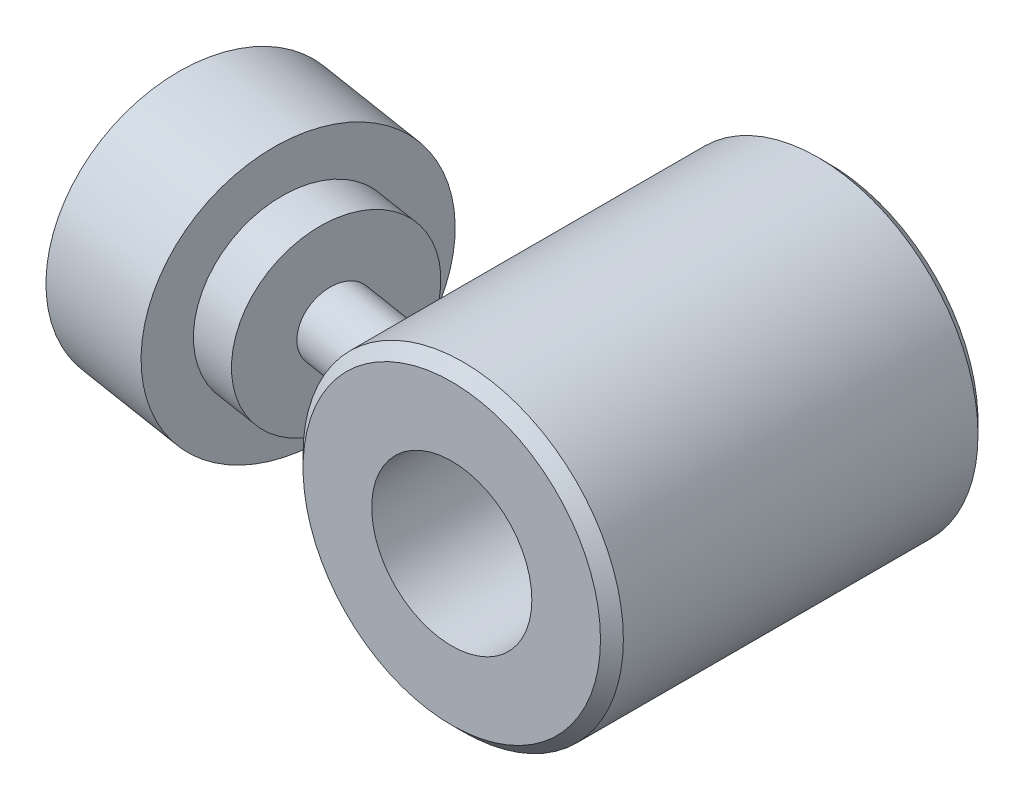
ISO-10303-21;
HEADER;
FILE_DESCRIPTION(('STEP AP214'),'2;1');
FILE_NAME('part.step','',(''),(''),'','','');
FILE_SCHEMA(('AUTOMOTIVE_DESIGN { 1 0 10303 214 1 1 1 1 }'));
ENDSEC;
DATA;
#1=APPLICATION_CONTEXT('core data for automotive mechanical design processes');
#2=APPLICATION_PROTOCOL_DEFINITION('international standard','automotive_design',2000,#1);
#3=PRODUCT_CONTEXT('',#1,'mechanical');
#4=PRODUCT('Part','Part','',(#3));
#5=PRODUCT_RELATED_PRODUCT_CATEGORY('part','',(#4));
#6=PRODUCT_DEFINITION_FORMATION('','',#4);
#7=PRODUCT_DEFINITION_CONTEXT('part definition',#1,'design');
#8=PRODUCT_DEFINITION('design','',#6,#7);
#9=PRODUCT_DEFINITION_SHAPE('','',#8);
#10=(LENGTH_UNIT() NAMED_UNIT(*) SI_UNIT(.MILLI.,.METRE.));
#11=(NAMED_UNIT(*) PLANE_ANGLE_UNIT() SI_UNIT($,.RADIAN.));
#12=(NAMED_UNIT(*) SI_UNIT($,.STERADIAN.) SOLID_ANGLE_UNIT());
#13=UNCERTAINTY_MEASURE_WITH_UNIT(LENGTH_MEASURE(1.E-05),#10,'distance_accuracy_value','');
#14=(GEOMETRIC_REPRESENTATION_CONTEXT(3) GLOBAL_UNCERTAINTY_ASSIGNED_CONTEXT((#13)) GLOBAL_UNIT_ASSIGNED_CONTEXT((#10,
#11,#12)) REPRESENTATION_CONTEXT('',''));
#15=CARTESIAN_POINT('',(0.,0.,0.));
#16=DIRECTION('',(0.,0.,1.));
#17=DIRECTION('',(1.,0.,0.));
#18=AXIS2_PLACEMENT_3D('',#15,#16,#17);
#19=CARTESIAN_POINT('',(-30.1019004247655,0.,19.4464415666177));
#20=DIRECTION('',(0.987688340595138,0.,0.156434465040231));
#21=DIRECTION('',(-0.156434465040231,0.,0.987688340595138));
#22=AXIS2_PLACEMENT_3D('',#19,#20,#21);
#23=CYLINDRICAL_SURFACE('',#22,3.);
#24=CARTESIAN_POINT('',(-14.,0.,25.0341274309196));
#25=CARTESIAN_POINT('',(-13.9999967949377,0.168510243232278,25.0341221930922));
#26=CARTESIAN_POINT('',(-13.9969271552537,0.337094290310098,25.020195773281));
#27=CARTESIAN_POINT('',(-13.9849715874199,0.669555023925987,24.9648179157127));
#28=CARTESIAN_POINT('',(-13.9760813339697,0.833428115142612,24.9233460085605));
#29=CARTESIAN_POINT('',(-13.9534610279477,1.15168232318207,24.8139527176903));
#30=CARTESIAN_POINT('',(-13.9397327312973,1.30606685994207,24.7460409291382));
#31=CARTESIAN_POINT('',(-13.9089449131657,1.60101990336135,24.585515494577));
#32=CARTESIAN_POINT('',(-13.8918858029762,1.74159011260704,24.4929048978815));
#33=CARTESIAN_POINT('',(-13.8563175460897,2.00503649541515,24.2853044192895));
#34=CARTESIAN_POINT('',(-13.8378075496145,2.12790217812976,24.1703013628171));
#35=CARTESIAN_POINT('',(-13.8014344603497,2.35230999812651,23.9210010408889));
#36=CARTESIAN_POINT('',(-13.7835713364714,2.45385316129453,23.7867047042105));
#37=CARTESIAN_POINT('',(-13.7506600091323,2.63201983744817,23.5035894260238));
#38=CARTESIAN_POINT('',(-13.7355918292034,2.70882333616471,23.3548861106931));
#39=CARTESIAN_POINT('',(-13.7098167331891,2.83640424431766,23.0463653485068));
#40=CARTESIAN_POINT('',(-13.6991093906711,2.88718419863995,22.8865489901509));
#41=CARTESIAN_POINT('',(-13.6833145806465,2.96113670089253,22.5620164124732));
#42=CARTESIAN_POINT('',(-13.678174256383,2.98456907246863,22.3973618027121));
#43=CARTESIAN_POINT('',(-13.6738246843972,3.00443368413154,22.0663677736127));
#44=CARTESIAN_POINT('',(-13.6746157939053,3.00086429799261,21.9000282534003));
#45=CARTESIAN_POINT('',(-13.6819874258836,2.9670717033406,21.568147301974));
#46=CARTESIAN_POINT('',(-13.6886395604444,2.93651878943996,21.4026412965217));
#47=CARTESIAN_POINT('',(-13.7070057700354,2.84955215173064,21.0788636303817));
#48=CARTESIAN_POINT('',(-13.7187209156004,2.79313295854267,20.9205935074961));
#49=CARTESIAN_POINT('',(-13.74639677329,2.65363814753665,20.6097298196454));
#50=CARTESIAN_POINT('',(-13.7624953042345,2.56967494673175,20.4575465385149));
#51=CARTESIAN_POINT('',(-13.7969051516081,2.37799586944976,20.169198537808));
#52=CARTESIAN_POINT('',(-13.8152169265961,2.27027506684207,20.0330371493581));
#53=CARTESIAN_POINT('',(-13.8524138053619,2.03114502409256,19.7778901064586));
#54=CARTESIAN_POINT('',(-13.8713028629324,1.89928479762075,19.6593264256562));
#55=CARTESIAN_POINT('',(-13.9070591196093,1.61676491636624,19.4468080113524));
#56=CARTESIAN_POINT('',(-13.9239266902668,1.46610872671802,19.3528487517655));
#57=CARTESIAN_POINT('',(-13.9531259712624,1.15495215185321,19.1955832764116));
#58=CARTESIAN_POINT('',(-13.9655807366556,0.99489434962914,19.1314266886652));
#59=CARTESIAN_POINT('',(-13.9851350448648,0.665674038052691,19.0323419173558));
#60=CARTESIAN_POINT('',(-13.9922370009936,0.496515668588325,18.9974005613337));
#61=CARTESIAN_POINT('',(-13.9999601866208,0.164539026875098,18.9594828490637));
#62=CARTESIAN_POINT('',(-14.0009354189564,0.00192682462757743,18.9547601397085));
#63=CARTESIAN_POINT('',(-13.9972387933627,-0.321677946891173,18.9728347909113));
#64=CARTESIAN_POINT('',(-13.9925677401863,-0.482670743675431,18.9956282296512));
#65=CARTESIAN_POINT('',(-13.9782819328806,-0.794662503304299,19.0669168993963));
#66=CARTESIAN_POINT('',(-13.9687839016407,-0.945806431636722,19.1148060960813));
#67=CARTESIAN_POINT('',(-13.9459117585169,-1.23817301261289,19.2341070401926));
#68=CARTESIAN_POINT('',(-13.932537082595,-1.37939421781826,19.3055222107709));
#69=CARTESIAN_POINT('',(-13.9027361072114,-1.65335871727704,19.472391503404));
#70=CARTESIAN_POINT('',(-13.886219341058,-1.78563190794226,19.5685998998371));
#71=CARTESIAN_POINT('',(-13.8521499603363,-2.03312031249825,19.7807508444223));
#72=CARTESIAN_POINT('',(-13.834597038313,-2.14833042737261,19.8966992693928));
#73=CARTESIAN_POINT('',(-13.7992103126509,-2.36528573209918,20.1523431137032));
#74=CARTESIAN_POINT('',(-13.7814176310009,-2.46588751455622,20.2930160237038));
#75=CARTESIAN_POINT('',(-13.7485751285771,-2.64287932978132,20.5891621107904));
#76=CARTESIAN_POINT('',(-13.7335258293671,-2.7192647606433,20.7446380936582));
#77=CARTESIAN_POINT('',(-13.7075647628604,-2.8472917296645,21.0703611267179));
#78=CARTESIAN_POINT('',(-13.6967658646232,-2.89826678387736,21.2408803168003));
#79=CARTESIAN_POINT('',(-13.6812453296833,-2.97067716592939,21.5883550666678));
#80=CARTESIAN_POINT('',(-13.6765226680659,-2.99211747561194,21.765309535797));
#81=CARTESIAN_POINT('',(-13.6738903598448,-3.00412361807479,22.1159975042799));
#82=CARTESIAN_POINT('',(-13.6758169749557,-2.99543143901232,22.2897039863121));
#83=CARTESIAN_POINT('',(-13.6859977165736,-2.94856526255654,22.6328985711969));
#84=CARTESIAN_POINT('',(-13.6942504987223,-2.91039752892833,22.8023875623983));
#85=CARTESIAN_POINT('',(-13.7157581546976,-2.80724460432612,23.1261522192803));
#86=CARTESIAN_POINT('',(-13.7288298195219,-2.74323434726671,23.2807515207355));
#87=CARTESIAN_POINT('',(-13.7585167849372,-2.59022388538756,23.5766639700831));
#88=CARTESIAN_POINT('',(-13.7751318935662,-2.50122503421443,23.717977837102));
#89=CARTESIAN_POINT('',(-13.8098952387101,-2.3015116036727,23.9823889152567));
#90=CARTESIAN_POINT('',(-13.8280309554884,-2.19096601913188,24.1056155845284));
#91=CARTESIAN_POINT('',(-13.8639494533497,-1.95079942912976,24.331919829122));
#92=CARTESIAN_POINT('',(-13.8817321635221,-1.82117463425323,24.434993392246));
#93=CARTESIAN_POINT('',(-13.915198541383,-1.54492775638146,24.6193716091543));
#94=CARTESIAN_POINT('',(-13.9308567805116,-1.3981333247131,24.700422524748));
#95=CARTESIAN_POINT('',(-13.958115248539,-1.09289844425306,24.8371247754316));
#96=CARTESIAN_POINT('',(-13.9697183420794,-0.934466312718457,24.892794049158));
#97=CARTESIAN_POINT('',(-13.9856285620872,-0.646628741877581,24.9679413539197));
#98=CARTESIAN_POINT('',(-13.9909861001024,-0.518637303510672,24.9927239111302));
#99=CARTESIAN_POINT('',(-13.9981730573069,-0.260445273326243,25.025818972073));
#100=CARTESIAN_POINT('',(-14.0000024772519,-0.130244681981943,25.0341314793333));
#101=CARTESIAN_POINT('',(-14.,0.,25.0341274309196));
#102=B_SPLINE_CURVE_WITH_KNOTS('',3,(#24,#25,#26,#27,#28,#29,#30,#31,#32,#33,#34,#35,#36,#37,
#38,#39,#40,#41,#42,#43,#44,#45,#46,#47,#48,#49,#50,#51,#52,#53,#54,#55,#56,#57,#58,#59,#60,#61,
#62,#63,#64,#65,#66,#67,#68,#69,#70,#71,#72,#73,#74,#75,#76,#77,#78,#79,#80,#81,#82,#83,#84,#85,
#86,#87,#88,#89,#90,#91,#92,#93,#94,#95,#96,#97,#98,#99,#100,#101),.UNSPECIFIED.,.T.,.F.,(4,2,2,
2,2,2,2,2,2,2,2,2,2,2,2,2,2,2,2,2,2,2,2,2,2,2,2,2,2,2,2,2,2,2,2,2,2,2,4),(0.,0.505061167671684,
1.01049807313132,1.5157517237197,2.02094302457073,2.5264324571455,3.03189756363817,
3.53359759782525,4.03524856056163,4.53209361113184,5.02896858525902,5.53200007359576,
6.03513797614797,6.55641269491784,7.0777956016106,7.6101556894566,8.14241777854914,
8.65838477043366,9.17411899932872,9.65975715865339,10.1453261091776,10.6196755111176,
11.0940939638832,11.5851268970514,12.0763062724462,12.5955122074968,13.114816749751,
13.6471065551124,14.1793065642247,14.6984956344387,15.2175744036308,15.7186691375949,
16.2197367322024,16.7170219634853,17.2144060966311,17.7172988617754,18.21983565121,
18.6102068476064,19.000577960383),.UNSPECIFIED.);
#103=CARTESIAN_POINT('',(-14.,0.,25.0341274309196));
#104=VERTEX_POINT('',#103);
#105=EDGE_CURVE('E248',#104,#104,#102,.T.);
#106=ORIENTED_EDGE('',*,*,#105,.T.);
#107=EDGE_LOOP('',(#106));
#108=FACE_BOUND('',#107,.T.);
#109=CARTESIAN_POINT('',(-22.4473157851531,0.,20.6588086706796));
#110=DIRECTION('',(-0.987688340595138,0.,-0.156434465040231));
#111=DIRECTION('',(0.,-1.,0.));
#112=AXIS2_PLACEMENT_3D('',#109,#110,#111);
#113=CIRCLE('',#112,3.);
#114=CARTESIAN_POINT('',(-22.4473157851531,-3.,20.6588086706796));
#115=VERTEX_POINT('',#114);
#116=EDGE_CURVE('E256',#115,#115,#113,.T.);
#117=ORIENTED_EDGE('',*,*,#116,.F.);
#118=EDGE_LOOP('',(#117));
#119=FACE_BOUND('',#118,.T.);
#120=ADVANCED_FACE('F17',(#108,#119),#23,.T.);
#121=CARTESIAN_POINT('',(-28.3489050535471,0.,22.7614841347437));
#122=DIRECTION('',(-0.987688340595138,0.,-0.156434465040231));
#123=DIRECTION('',(0.156434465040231,0.,-0.987688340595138));
#124=AXIS2_PLACEMENT_3D('',#121,#122,#123);
#125=PLANE('',#124);
#126=DIRECTION('',(0.135476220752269,0.5,-0.855363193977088));
#127=VECTOR('',#126,1.);
#128=CARTESIAN_POINT('',(-28.1142533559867,0.866025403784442,21.279951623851));
#129=LINE('',#128,#127);
#130=CARTESIAN_POINT('',(-28.1142533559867,0.866025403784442,21.279951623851));
#131=VERTEX_POINT('',#130);
#132=CARTESIAN_POINT('',(-27.8796016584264,1.73205080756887,19.7984191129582));
#133=VERTEX_POINT('',#132);
#134=EDGE_CURVE('E387',#131,#133,#129,.T.);
#135=ORIENTED_EDGE('',*,*,#134,.T.);
#136=DIRECTION('',(-0.135476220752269,0.5,0.855363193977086));
#137=VECTOR('',#136,1.);
#138=CARTESIAN_POINT('',(-27.644949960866,0.866025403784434,18.3168866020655));
#139=LINE('',#138,#137);
#140=CARTESIAN_POINT('',(-27.644949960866,0.866025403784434,18.3168866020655));
#141=VERTEX_POINT('',#140);
#142=EDGE_CURVE('E385',#141,#133,#139,.T.);
#143=ORIENTED_EDGE('',*,*,#142,.F.);
#144=DIRECTION('',(0.,1.,0.));
#145=VECTOR('',#144,1.);
#146=CARTESIAN_POINT('',(-27.644949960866,-0.866025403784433,18.3168866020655));
#147=LINE('',#146,#145);
#148=CARTESIAN_POINT('',(-27.644949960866,-0.866025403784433,18.3168866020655));
#149=VERTEX_POINT('',#148);
#150=EDGE_CURVE('E388',#149,#141,#147,.T.);
#151=ORIENTED_EDGE('',*,*,#150,.F.);
#152=DIRECTION('',(-0.135476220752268,-0.5,0.855363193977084));
#153=VECTOR('',#152,1.);
#154=CARTESIAN_POINT('',(-27.644949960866,-0.866025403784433,18.3168866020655));
#155=LINE('',#154,#153);
#156=CARTESIAN_POINT('',(-27.8796016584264,-1.73205080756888,19.7984191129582));
#157=VERTEX_POINT('',#156);
#158=EDGE_CURVE('E818',#149,#157,#155,.T.);
#159=ORIENTED_EDGE('',*,*,#158,.T.);
#160=DIRECTION('',(0.135476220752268,-0.5,-0.855363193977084));
#161=VECTOR('',#160,1.);
#162=CARTESIAN_POINT('',(-28.1142533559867,-0.866025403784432,21.279951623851));
#163=LINE('',#162,#161);
#164=CARTESIAN_POINT('',(-28.1142533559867,-0.866025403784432,21.279951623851));
#165=VERTEX_POINT('',#164);
#166=EDGE_CURVE('E374',#165,#157,#163,.T.);
#167=ORIENTED_EDGE('',*,*,#166,.F.);
#168=DIRECTION('',(0.,1.,0.));
#169=VECTOR('',#168,1.);
#170=CARTESIAN_POINT('',(-28.1142533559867,-0.866025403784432,21.279951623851));
#171=LINE('',#170,#169);
#172=EDGE_CURVE('E384',#165,#131,#171,.T.);
#173=ORIENTED_EDGE('',*,*,#172,.T.);
#174=EDGE_LOOP('',(#135,#143,#151,#159,#167,#173));
#175=FACE_BOUND('',#174,.T.);
#176=ADVANCED_FACE('F203',(#175),#125,.T.);
#177=CARTESIAN_POINT('',(-27.644949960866,-0.866025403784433,18.3168866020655));
#178=DIRECTION('',(-0.156434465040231,0.,0.987688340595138));
#179=DIRECTION('',(0.,-1.,0.));
#180=AXIS2_PLACEMENT_3D('',#177,#178,#179);
#181=PLANE('',#180);
#182=DIRECTION('',(-0.987688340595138,0.,-0.156434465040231));
#183=VECTOR('',#182,1.);
#184=CARTESIAN_POINT('',(-27.644949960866,0.866025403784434,18.3168866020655));
#185=LINE('',#184,#183);
#186=CARTESIAN_POINT('',(-30.1141708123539,0.866025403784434,17.925800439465));
#187=VERTEX_POINT('',#186);
#188=EDGE_CURVE('E809',#141,#187,#185,.T.);
#189=ORIENTED_EDGE('',*,*,#188,.T.);
#190=DIRECTION('',(0.,1.,0.));
#191=VECTOR('',#190,1.);
#192=CARTESIAN_POINT('',(-30.1141708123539,-0.866025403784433,17.925800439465));
#193=LINE('',#192,#191);
#194=CARTESIAN_POINT('',(-30.1141708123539,-0.866025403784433,17.925800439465));
#195=VERTEX_POINT('',#194);
#196=EDGE_CURVE('E381',#195,#187,#193,.T.);
#197=ORIENTED_EDGE('',*,*,#196,.F.);
#198=DIRECTION('',(-0.987688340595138,0.,-0.156434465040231));
#199=VECTOR('',#198,1.);
#200=CARTESIAN_POINT('',(-27.644949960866,-0.866025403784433,18.3168866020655));
#201=LINE('',#200,#199);
#202=EDGE_CURVE('E805',#149,#195,#201,.T.);
#203=ORIENTED_EDGE('',*,*,#202,.F.);
#204=ORIENTED_EDGE('',*,*,#150,.T.);
#205=EDGE_LOOP('',(#189,#197,#203,#204));
#206=FACE_BOUND('',#205,.T.);
#207=ADVANCED_FACE('F208',(#206),#181,.T.);
#208=CARTESIAN_POINT('',(-27.644949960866,-0.866025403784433,18.3168866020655));
#209=DIRECTION('',(0.0782172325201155,-0.866025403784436,-0.493844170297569));
#210=DIRECTION('',(0.135476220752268,0.5,-0.855363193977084));
#211=AXIS2_PLACEMENT_3D('',#208,#209,#210);
#212=PLANE('',#211);
#213=ORIENTED_EDGE('',*,*,#202,.T.);
#214=DIRECTION('',(-0.135476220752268,-0.5,0.855363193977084));
#215=VECTOR('',#214,1.);
#216=CARTESIAN_POINT('',(-30.1141708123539,-0.866025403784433,17.925800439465));
#217=LINE('',#216,#215);
#218=CARTESIAN_POINT('',(-30.3488225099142,-1.73205080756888,19.4073329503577));
#219=VERTEX_POINT('',#218);
#220=EDGE_CURVE('E831',#195,#219,#217,.T.);
#221=ORIENTED_EDGE('',*,*,#220,.T.);
#222=DIRECTION('',(-0.987688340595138,0.,-0.156434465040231));
#223=VECTOR('',#222,1.);
#224=CARTESIAN_POINT('',(-27.8796016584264,-1.73205080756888,19.7984191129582));
#225=LINE('',#224,#223);
#226=EDGE_CURVE('E802',#157,#219,#225,.T.);
#227=ORIENTED_EDGE('',*,*,#226,.F.);
#228=ORIENTED_EDGE('',*,*,#158,.F.);
#229=EDGE_LOOP('',(#213,#221,#227,#228));
#230=FACE_BOUND('',#229,.T.);
#231=ADVANCED_FACE('F222',(#230),#212,.F.);
#232=CARTESIAN_POINT('',(-28.1142533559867,-0.866025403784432,21.279951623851));
#233=DIRECTION('',(0.0782172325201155,0.866025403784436,-0.493844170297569));
#234=DIRECTION('',(-0.135476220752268,0.5,0.855363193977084));
#235=AXIS2_PLACEMENT_3D('',#232,#233,#234);
#236=PLANE('',#235);
#237=ORIENTED_EDGE('',*,*,#226,.T.);
#238=DIRECTION('',(0.135476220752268,-0.5,-0.855363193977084));
#239=VECTOR('',#238,1.);
#240=CARTESIAN_POINT('',(-30.5834742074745,-0.866025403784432,20.8888654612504));
#241=LINE('',#240,#239);
#242=CARTESIAN_POINT('',(-30.5834742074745,-0.866025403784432,20.8888654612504));
#243=VERTEX_POINT('',#242);
#244=EDGE_CURVE('E828',#243,#219,#241,.T.);
#245=ORIENTED_EDGE('',*,*,#244,.F.);
#246=DIRECTION('',(-0.987688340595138,0.,-0.156434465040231));
#247=VECTOR('',#246,1.);
#248=CARTESIAN_POINT('',(-28.1142533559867,-0.866025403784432,21.279951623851));
#249=LINE('',#248,#247);
#250=EDGE_CURVE('E797',#165,#243,#249,.T.);
#251=ORIENTED_EDGE('',*,*,#250,.F.);
#252=ORIENTED_EDGE('',*,*,#166,.T.);
#253=EDGE_LOOP('',(#237,#245,#251,#252));
#254=FACE_BOUND('',#253,.T.);
#255=ADVANCED_FACE('F226',(#254),#236,.T.);
#256=CARTESIAN_POINT('',(-28.1142533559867,-0.866025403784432,21.279951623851));
#257=DIRECTION('',(-0.156434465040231,0.,0.987688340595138));
#258=DIRECTION('',(0.,-1.,0.));
#259=AXIS2_PLACEMENT_3D('',#256,#257,#258);
#260=PLANE('',#259);
#261=ORIENTED_EDGE('',*,*,#250,.T.);
#262=DIRECTION('',(0.,1.,0.));
#263=VECTOR('',#262,1.);
#264=CARTESIAN_POINT('',(-30.5834742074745,-0.866025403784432,20.8888654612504));
#265=LINE('',#264,#263);
#266=CARTESIAN_POINT('',(-30.5834742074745,0.866025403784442,20.8888654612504));
#267=VERTEX_POINT('',#266);
#268=EDGE_CURVE('E289',#243,#267,#265,.T.);
#269=ORIENTED_EDGE('',*,*,#268,.T.);
#270=DIRECTION('',(-0.987688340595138,0.,-0.156434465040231));
#271=VECTOR('',#270,1.);
#272=CARTESIAN_POINT('',(-28.1142533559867,0.866025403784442,21.279951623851));
#273=LINE('',#272,#271);
#274=EDGE_CURVE('E793',#131,#267,#273,.T.);
#275=ORIENTED_EDGE('',*,*,#274,.F.);
#276=ORIENTED_EDGE('',*,*,#172,.F.);
#277=EDGE_LOOP('',(#261,#269,#275,#276));
#278=FACE_BOUND('',#277,.T.);
#279=ADVANCED_FACE('F215',(#278),#260,.F.);
#280=CARTESIAN_POINT('',(-28.1142533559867,0.866025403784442,21.279951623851));
#281=DIRECTION('',(-0.0782172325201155,0.86602540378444,0.493844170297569));
#282=DIRECTION('',(-0.135476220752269,-0.5,0.855363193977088));
#283=AXIS2_PLACEMENT_3D('',#280,#281,#282);
#284=PLANE('',#283);
#285=ORIENTED_EDGE('',*,*,#274,.T.);
#286=DIRECTION('',(0.135476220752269,0.5,-0.855363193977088));
#287=VECTOR('',#286,1.);
#288=CARTESIAN_POINT('',(-30.5834742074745,0.866025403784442,20.8888654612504));
#289=LINE('',#288,#287);
#290=CARTESIAN_POINT('',(-30.3488225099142,1.73205080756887,19.4073329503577));
#291=VERTEX_POINT('',#290);
#292=EDGE_CURVE('E42',#267,#291,#289,.T.);
#293=ORIENTED_EDGE('',*,*,#292,.T.);
#294=DIRECTION('',(-0.987688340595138,0.,-0.156434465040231));
#295=VECTOR('',#294,1.);
#296=CARTESIAN_POINT('',(-27.8796016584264,1.73205080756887,19.7984191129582));
#297=LINE('',#296,#295);
#298=EDGE_CURVE('E813',#133,#291,#297,.T.);
#299=ORIENTED_EDGE('',*,*,#298,.F.);
#300=ORIENTED_EDGE('',*,*,#134,.F.);
#301=EDGE_LOOP('',(#285,#293,#299,#300));
#302=FACE_BOUND('',#301,.T.);
#303=ADVANCED_FACE('F211',(#302),#284,.F.);
#304=CARTESIAN_POINT('',(-27.644949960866,0.866025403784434,18.3168866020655));
#305=DIRECTION('',(-0.0782172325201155,-0.866025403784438,0.493844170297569));
#306=DIRECTION('',(0.135476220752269,-0.5,-0.855363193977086));
#307=AXIS2_PLACEMENT_3D('',#304,#305,#306);
#308=PLANE('',#307);
#309=ORIENTED_EDGE('',*,*,#142,.T.);
#310=ORIENTED_EDGE('',*,*,#298,.T.);
#311=DIRECTION('',(-0.135476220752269,0.5,0.855363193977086));
#312=VECTOR('',#311,1.);
#313=CARTESIAN_POINT('',(-30.1141708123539,0.866025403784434,17.925800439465));
#314=LINE('',#313,#312);
#315=EDGE_CURVE('E378',#187,#291,#314,.T.);
#316=ORIENTED_EDGE('',*,*,#315,.F.);
#317=ORIENTED_EDGE('',*,*,#188,.F.);
#318=EDGE_LOOP('',(#309,#310,#316,#317));
#319=FACE_BOUND('',#318,.T.);
#320=ADVANCED_FACE('F214',(#319),#308,.T.);
#321=CARTESIAN_POINT('',(-30.3488225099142,0.,19.4073329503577));
#322=DIRECTION('',(0.987688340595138,0.,0.156434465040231));
#323=DIRECTION('',(-0.156434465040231,0.,0.987688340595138));
#324=AXIS2_PLACEMENT_3D('',#321,#322,#323);
#325=PLANE('',#324);
#326=ORIENTED_EDGE('',*,*,#315,.T.);
#327=ORIENTED_EDGE('',*,*,#292,.F.);
#328=ORIENTED_EDGE('',*,*,#268,.F.);
#329=ORIENTED_EDGE('',*,*,#244,.T.);
#330=ORIENTED_EDGE('',*,*,#220,.F.);
#331=ORIENTED_EDGE('',*,*,#196,.T.);
#332=EDGE_LOOP('',(#326,#327,#328,#329,#330,#331));
#333=FACE_BOUND('',#332,.T.);
#334=CARTESIAN_POINT('',(-30.3488225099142,0.,19.4073329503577));
#335=DIRECTION('',(0.987688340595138,0.,0.156434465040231));
#336=DIRECTION('',(-0.156434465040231,0.,0.987688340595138));
#337=AXIS2_PLACEMENT_3D('',#334,#335,#336);
#338=CIRCLE('',#337,2.5);
#339=CARTESIAN_POINT('',(-30.7399086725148,0.,21.8765538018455));
#340=VERTEX_POINT('',#339);
#341=EDGE_CURVE('E789',#340,#340,#338,.T.);
#342=ORIENTED_EDGE('',*,*,#341,.F.);
#343=EDGE_LOOP('',(#342));
#344=FACE_BOUND('',#343,.T.);
#345=ADVANCED_FACE('F218',(#333,#344),#325,.F.);
#346=CARTESIAN_POINT('',(-29.8549783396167,0.,19.4855501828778));
#347=DIRECTION('',(0.987688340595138,0.,0.156434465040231));
#348=DIRECTION('',(-0.156434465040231,0.,0.987688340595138));
#349=AXIS2_PLACEMENT_3D('',#346,#347,#348);
#350=CONICAL_SURFACE('',#349,3.,0.785398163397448);
#351=ORIENTED_EDGE('',*,*,#341,.T.);
#352=EDGE_LOOP('',(#351));
#353=FACE_BOUND('',#352,.T.);
#354=CARTESIAN_POINT('',(-29.8549783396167,0.,19.4855501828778));
#355=DIRECTION('',(0.987688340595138,0.,0.156434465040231));
#356=DIRECTION('',(-0.156434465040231,0.,0.987688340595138));
#357=AXIS2_PLACEMENT_3D('',#354,#355,#356);
#358=CIRCLE('',#357,3.);
#359=CARTESIAN_POINT('',(-30.3242817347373,0.,22.4486152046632));
#360=VERTEX_POINT('',#359);
#361=EDGE_CURVE('E257',#360,#360,#358,.T.);
#362=ORIENTED_EDGE('',*,*,#361,.F.);
#363=EDGE_LOOP('',(#362));
#364=FACE_BOUND('',#363,.T.);
#365=ADVANCED_FACE('F236',(#353,#364),#350,.T.);
#366=CARTESIAN_POINT('',(0.,-11.,22.1547005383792));
#367=DIRECTION('',(0.,-1.,0.));
#368=DIRECTION('',(1.,0.,0.));
#369=AXIS2_PLACEMENT_3D('',#366,#367,#368);
#370=PLANE('',#369);
#371=DIRECTION('',(-0.866025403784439,0.,0.5));
#372=VECTOR('',#371,1.);
#373=CARTESIAN_POINT('',(1.,-11.,21.5773502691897));
#374=LINE('',#373,#372);
#375=CARTESIAN_POINT('',(1.,-11.,21.5773502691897));
#376=VERTEX_POINT('',#375);
#377=CARTESIAN_POINT('',(0.,-11.,22.1547005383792));
#378=VERTEX_POINT('',#377);
#379=EDGE_CURVE('E90',#376,#378,#374,.T.);
#380=ORIENTED_EDGE('',*,*,#379,.T.);
#381=DIRECTION('',(-0.866025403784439,0.,-0.5));
#382=VECTOR('',#381,1.);
#383=CARTESIAN_POINT('',(0.,-11.,22.1547005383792));
#384=LINE('',#383,#382);
#385=CARTESIAN_POINT('',(-1.,-11.,21.5773502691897));
#386=VERTEX_POINT('',#385);
#387=EDGE_CURVE('E292',#378,#386,#384,.T.);
#388=ORIENTED_EDGE('',*,*,#387,.T.);
#389=DIRECTION('',(0.,0.,-1.));
#390=VECTOR('',#389,1.);
#391=CARTESIAN_POINT('',(-1.,-11.,21.5773502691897));
#392=LINE('',#391,#390);
#393=CARTESIAN_POINT('',(-1.,-11.,20.4226497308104));
#394=VERTEX_POINT('',#393);
#395=EDGE_CURVE('E296',#386,#394,#392,.T.);
#396=ORIENTED_EDGE('',*,*,#395,.T.);
#397=DIRECTION('',(0.866025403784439,0.,-0.5));
#398=VECTOR('',#397,1.);
#399=CARTESIAN_POINT('',(-1.,-11.,20.4226497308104));
#400=LINE('',#399,#398);
#401=CARTESIAN_POINT('',(0.,-11.,19.8452994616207));
#402=VERTEX_POINT('',#401);
#403=EDGE_CURVE('E300',#394,#402,#400,.T.);
#404=ORIENTED_EDGE('',*,*,#403,.T.);
#405=DIRECTION('',(0.866025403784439,0.,0.5));
#406=VECTOR('',#405,1.);
#407=CARTESIAN_POINT('',(0.,-11.,19.8452994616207));
#408=LINE('',#407,#406);
#409=CARTESIAN_POINT('',(1.,-11.,20.4226497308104));
#410=VERTEX_POINT('',#409);
#411=EDGE_CURVE('E303',#402,#410,#408,.T.);
#412=ORIENTED_EDGE('',*,*,#411,.T.);
#413=DIRECTION('',(0.,0.,1.));
#414=VECTOR('',#413,1.);
#415=CARTESIAN_POINT('',(1.,-11.,20.4226497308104));
#416=LINE('',#415,#414);
#417=EDGE_CURVE('E126',#410,#376,#416,.T.);
#418=ORIENTED_EDGE('',*,*,#417,.T.);
#419=EDGE_LOOP('',(#380,#388,#396,#404,#412,#418));
#420=FACE_BOUND('',#419,.T.);
#421=ADVANCED_FACE('F240',(#420),#370,.T.);
#422=CARTESIAN_POINT('',(0.,-11.,22.1547005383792));
#423=DIRECTION('',(-0.5,0.,0.866025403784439));
#424=DIRECTION('',(-0.866025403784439,0.,-0.5));
#425=AXIS2_PLACEMENT_3D('',#422,#423,#424);
#426=PLANE('',#425);
#427=DIRECTION('',(-0.866025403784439,0.,-0.5));
#428=VECTOR('',#427,1.);
#429=CARTESIAN_POINT('',(0.,-12.5,22.1547005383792));
#430=LINE('',#429,#428);
#431=CARTESIAN_POINT('',(0.,-12.5,22.1547005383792));
#432=VERTEX_POINT('',#431);
#433=CARTESIAN_POINT('',(-1.,-12.5,21.5773502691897));
#434=VERTEX_POINT('',#433);
#435=EDGE_CURVE('E112',#432,#434,#430,.T.);
#436=ORIENTED_EDGE('',*,*,#435,.T.);
#437=DIRECTION('',(0.,-1.,0.));
#438=VECTOR('',#437,1.);
#439=CARTESIAN_POINT('',(-1.,-11.,21.5773502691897));
#440=LINE('',#439,#438);
#441=EDGE_CURVE('E144',#386,#434,#440,.T.);
#442=ORIENTED_EDGE('',*,*,#441,.F.);
#443=ORIENTED_EDGE('',*,*,#387,.F.);
#444=DIRECTION('',(0.,-1.,0.));
#445=VECTOR('',#444,1.);
#446=CARTESIAN_POINT('',(0.,-11.,22.1547005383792));
#447=LINE('',#446,#445);
#448=EDGE_CURVE('E147',#378,#432,#447,.T.);
#449=ORIENTED_EDGE('',*,*,#448,.T.);
#450=EDGE_LOOP('',(#436,#442,#443,#449));
#451=FACE_BOUND('',#450,.T.);
#452=ADVANCED_FACE('F316',(#451),#426,.F.);
#453=CARTESIAN_POINT('',(-1.,-11.,21.5773502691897));
#454=DIRECTION('',(-1.,0.,0.));
#455=DIRECTION('',(0.,0.,-1.));
#456=AXIS2_PLACEMENT_3D('',#453,#454,#455);
#457=PLANE('',#456);
#458=DIRECTION('',(0.,0.,-1.));
#459=VECTOR('',#458,1.);
#460=CARTESIAN_POINT('',(-1.,-12.5,21.5773502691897));
#461=LINE('',#460,#459);
#462=CARTESIAN_POINT('',(-1.,-12.5,20.4226497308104));
#463=VERTEX_POINT('',#462);
#464=EDGE_CURVE('E120',#434,#463,#461,.T.);
#465=ORIENTED_EDGE('',*,*,#464,.T.);
#466=DIRECTION('',(0.,-1.,0.));
#467=VECTOR('',#466,1.);
#468=CARTESIAN_POINT('',(-1.,-11.,20.4226497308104));
#469=LINE('',#468,#467);
#470=EDGE_CURVE('E141',#394,#463,#469,.T.);
#471=ORIENTED_EDGE('',*,*,#470,.F.);
#472=ORIENTED_EDGE('',*,*,#395,.F.);
#473=ORIENTED_EDGE('',*,*,#441,.T.);
#474=EDGE_LOOP('',(#465,#471,#472,#473));
#475=FACE_BOUND('',#474,.T.);
#476=ADVANCED_FACE('F318',(#475),#457,.F.);
#477=CARTESIAN_POINT('',(-1.,-11.,20.4226497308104));
#478=DIRECTION('',(-0.5,0.,-0.866025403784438));
#479=DIRECTION('',(0.866025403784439,0.,-0.5));
#480=AXIS2_PLACEMENT_3D('',#477,#478,#479);
#481=PLANE('',#480);
#482=DIRECTION('',(0.866025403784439,0.,-0.5));
#483=VECTOR('',#482,1.);
#484=CARTESIAN_POINT('',(-1.,-12.5,20.4226497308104));
#485=LINE('',#484,#483);
#486=CARTESIAN_POINT('',(0.,-12.5,19.8452994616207));
#487=VERTEX_POINT('',#486);
#488=EDGE_CURVE('E131',#463,#487,#485,.T.);
#489=ORIENTED_EDGE('',*,*,#488,.T.);
#490=DIRECTION('',(0.,-1.,0.));
#491=VECTOR('',#490,1.);
#492=CARTESIAN_POINT('',(0.,-11.,19.8452994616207));
#493=LINE('',#492,#491);
#494=EDGE_CURVE('E139',#402,#487,#493,.T.);
#495=ORIENTED_EDGE('',*,*,#494,.F.);
#496=ORIENTED_EDGE('',*,*,#403,.F.);
#497=ORIENTED_EDGE('',*,*,#470,.T.);
#498=EDGE_LOOP('',(#489,#495,#496,#497));
#499=FACE_BOUND('',#498,.T.);
#500=ADVANCED_FACE('F322',(#499),#481,.F.);
#501=CARTESIAN_POINT('',(0.,-11.,19.8452994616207));
#502=DIRECTION('',(0.5,0.,-0.866025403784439));
#503=DIRECTION('',(0.866025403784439,0.,0.5));
#504=AXIS2_PLACEMENT_3D('',#501,#502,#503);
#505=PLANE('',#504);
#506=DIRECTION('',(0.866025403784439,0.,0.5));
#507=VECTOR('',#506,1.);
#508=CARTESIAN_POINT('',(0.,-12.5,19.8452994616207));
#509=LINE('',#508,#507);
#510=CARTESIAN_POINT('',(1.,-12.5,20.4226497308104));
#511=VERTEX_POINT('',#510);
#512=EDGE_CURVE('E105',#487,#511,#509,.T.);
#513=ORIENTED_EDGE('',*,*,#512,.T.);
#514=DIRECTION('',(0.,-1.,0.));
#515=VECTOR('',#514,1.);
#516=CARTESIAN_POINT('',(1.,-11.,20.4226497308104));
#517=LINE('',#516,#515);
#518=EDGE_CURVE('E96',#410,#511,#517,.T.);
#519=ORIENTED_EDGE('',*,*,#518,.F.);
#520=ORIENTED_EDGE('',*,*,#411,.F.);
#521=ORIENTED_EDGE('',*,*,#494,.T.);
#522=EDGE_LOOP('',(#513,#519,#520,#521));
#523=FACE_BOUND('',#522,.T.);
#524=ADVANCED_FACE('F324',(#523),#505,.F.);
#525=CARTESIAN_POINT('',(1.,-11.,20.4226497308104));
#526=DIRECTION('',(1.,0.,0.));
#527=DIRECTION('',(0.,1.,0.));
#528=AXIS2_PLACEMENT_3D('',#525,#526,#527);
#529=PLANE('',#528);
#530=DIRECTION('',(0.,0.,1.));
#531=VECTOR('',#530,1.);
#532=CARTESIAN_POINT('',(1.,-12.5,20.4226497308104));
#533=LINE('',#532,#531);
#534=CARTESIAN_POINT('',(1.,-12.5,21.5773502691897));
#535=VERTEX_POINT('',#534);
#536=EDGE_CURVE('E99',#511,#535,#533,.T.);
#537=ORIENTED_EDGE('',*,*,#536,.T.);
#538=DIRECTION('',(0.,-1.,0.));
#539=VECTOR('',#538,1.);
#540=CARTESIAN_POINT('',(1.,-11.,21.5773502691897));
#541=LINE('',#540,#539);
#542=EDGE_CURVE('E83',#376,#535,#541,.T.);
#543=ORIENTED_EDGE('',*,*,#542,.F.);
#544=ORIENTED_EDGE('',*,*,#417,.F.);
#545=ORIENTED_EDGE('',*,*,#518,.T.);
#546=EDGE_LOOP('',(#537,#543,#544,#545));
#547=FACE_BOUND('',#546,.T.);
#548=ADVANCED_FACE('F100',(#547),#529,.F.);
#549=CARTESIAN_POINT('',(1.,-11.,21.5773502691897));
#550=DIRECTION('',(0.5,0.,0.866025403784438));
#551=DIRECTION('',(-0.866025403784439,0.,0.5));
#552=AXIS2_PLACEMENT_3D('',#549,#550,#551);
#553=PLANE('',#552);
#554=DIRECTION('',(-0.866025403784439,0.,0.5));
#555=VECTOR('',#554,1.);
#556=CARTESIAN_POINT('',(1.,-12.5,21.5773502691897));
#557=LINE('',#556,#555);
#558=EDGE_CURVE('E87',#535,#432,#557,.T.);
#559=ORIENTED_EDGE('',*,*,#558,.T.);
#560=ORIENTED_EDGE('',*,*,#448,.F.);
#561=ORIENTED_EDGE('',*,*,#379,.F.);
#562=ORIENTED_EDGE('',*,*,#542,.T.);
#563=EDGE_LOOP('',(#559,#560,#561,#562));
#564=FACE_BOUND('',#563,.T.);
#565=ADVANCED_FACE('F85',(#564),#553,.F.);
#566=CARTESIAN_POINT('',(0.,0.,0.));
#567=DIRECTION('',(0.,0.,1.));
#568=DIRECTION('',(1.,0.,0.));
#569=AXIS2_PLACEMENT_3D('',#566,#567,#568);
#570=CYLINDRICAL_SURFACE('',#569,3.3);
#571=CARTESIAN_POINT('',(0.,0.,0.));
#572=DIRECTION('',(0.,0.,1.));
#573=DIRECTION('',(1.,0.,0.));
#574=AXIS2_PLACEMENT_3D('',#571,#572,#573);
#575=CIRCLE('',#574,3.3);
#576=CARTESIAN_POINT('',(3.3,0.,0.));
#577=VERTEX_POINT('',#576);
#578=EDGE_CURVE('E393',#577,#577,#575,.T.);
#579=ORIENTED_EDGE('',*,*,#578,.F.);
#580=EDGE_LOOP('',(#579));
#581=FACE_BOUND('',#580,.T.);
#582=CARTESIAN_POINT('',(0.,0.,6.));
#583=DIRECTION('',(0.,0.,1.));
#584=DIRECTION('',(1.,0.,0.));
#585=AXIS2_PLACEMENT_3D('',#582,#583,#584);
#586=CIRCLE('',#585,3.3);
#587=CARTESIAN_POINT('',(3.3,0.,6.));
#588=VERTEX_POINT('',#587);
#589=EDGE_CURVE('E376',#588,#588,#586,.T.);
#590=ORIENTED_EDGE('',*,*,#589,.T.);
#591=EDGE_LOOP('',(#590));
#592=FACE_BOUND('',#591,.T.);
#593=ADVANCED_FACE('F358',(#581,#592),#570,.F.);
#594=CARTESIAN_POINT('',(7.,0.,6.));
#595=DIRECTION('',(0.,0.,-1.));
#596=DIRECTION('',(-1.,0.,0.));
#597=AXIS2_PLACEMENT_3D('',#594,#595,#596);
#598=PLANE('',#597);
#599=ORIENTED_EDGE('',*,*,#589,.F.);
#600=EDGE_LOOP('',(#599));
#601=FACE_BOUND('',#600,.T.);
#602=CARTESIAN_POINT('',(0.,0.,6.));
#603=DIRECTION('',(0.,0.,1.));
#604=DIRECTION('',(1.,0.,0.));
#605=AXIS2_PLACEMENT_3D('',#602,#603,#604);
#606=CIRCLE('',#605,7.);
#607=CARTESIAN_POINT('',(7.,0.,6.));
#608=VERTEX_POINT('',#607);
#609=EDGE_CURVE('E454',#608,#608,#606,.T.);
#610=ORIENTED_EDGE('',*,*,#609,.T.);
#611=EDGE_LOOP('',(#610));
#612=FACE_BOUND('',#611,.T.);
#613=ADVANCED_FACE('F432',(#601,#612),#598,.F.);
#614=CARTESIAN_POINT('',(0.,-12.5,21.));
#615=DIRECTION('',(0.,-1.,0.));
#616=DIRECTION('',(1.,0.,0.));
#617=AXIS2_PLACEMENT_3D('',#614,#615,#616);
#618=PLANE('',#617);
#619=ORIENTED_EDGE('',*,*,#558,.F.);
#620=ORIENTED_EDGE('',*,*,#536,.F.);
#621=ORIENTED_EDGE('',*,*,#512,.F.);
#622=ORIENTED_EDGE('',*,*,#488,.F.);
#623=ORIENTED_EDGE('',*,*,#464,.F.);
#624=ORIENTED_EDGE('',*,*,#435,.F.);
#625=EDGE_LOOP('',(#619,#620,#621,#622,#623,#624));
#626=FACE_BOUND('',#625,.T.);
#627=CARTESIAN_POINT('',(0.,-12.5,21.));
#628=DIRECTION('',(0.,-1.,0.));
#629=DIRECTION('',(1.,0.,0.));
#630=AXIS2_PLACEMENT_3D('',#627,#628,#629);
#631=CIRCLE('',#630,2.);
#632=CARTESIAN_POINT('',(2.,-12.5,21.));
#633=VERTEX_POINT('',#632);
#634=EDGE_CURVE('E153',#633,#633,#631,.T.);
#635=ORIENTED_EDGE('',*,*,#634,.T.);
#636=EDGE_LOOP('',(#635));
#637=FACE_BOUND('',#636,.T.);
#638=ADVANCED_FACE('F108',(#626,#637),#618,.T.);
#639=CARTESIAN_POINT('',(0.,0.,0.));
#640=DIRECTION('',(0.,0.,1.));
#641=DIRECTION('',(1.,0.,0.));
#642=AXIS2_PLACEMENT_3D('',#639,#640,#641);
#643=CYLINDRICAL_SURFACE('',#642,7.);
#644=CARTESIAN_POINT('',(0.,0.,33.));
#645=DIRECTION('',(0.,0.,1.));
#646=DIRECTION('',(1.,0.,0.));
#647=AXIS2_PLACEMENT_3D('',#644,#645,#646);
#648=CIRCLE('',#647,7.);
#649=CARTESIAN_POINT('',(7.,0.,33.));
#650=VERTEX_POINT('',#649);
#651=EDGE_CURVE('E401',#650,#650,#648,.T.);
#652=ORIENTED_EDGE('',*,*,#651,.T.);
#653=EDGE_LOOP('',(#652));
#654=FACE_BOUND('',#653,.T.);
#655=ORIENTED_EDGE('',*,*,#609,.F.);
#656=EDGE_LOOP('',(#655));
#657=FACE_BOUND('',#656,.T.);
#658=ADVANCED_FACE('F420',(#654,#657),#643,.F.);
#659=CARTESIAN_POINT('',(0.,0.,33.));
#660=DIRECTION('',(0.,0.,1.));
#661=DIRECTION('',(1.,0.,0.));
#662=AXIS2_PLACEMENT_3D('',#659,#660,#661);
#663=PLANE('',#662);
#664=CARTESIAN_POINT('',(0.,0.,33.));
#665=DIRECTION('',(0.,0.,1.));
#666=DIRECTION('',(1.,0.,0.));
#667=AXIS2_PLACEMENT_3D('',#664,#665,#666);
#668=CIRCLE('',#667,13.);
#669=CARTESIAN_POINT('',(13.,0.,33.));
#670=VERTEX_POINT('',#669);
#671=EDGE_CURVE('E114',#670,#670,#668,.T.);
#672=ORIENTED_EDGE('',*,*,#671,.T.);
#673=EDGE_LOOP('',(#672));
#674=FACE_BOUND('',#673,.T.);
#675=ORIENTED_EDGE('',*,*,#651,.F.);
#676=EDGE_LOOP('',(#675));
#677=FACE_BOUND('',#676,.T.);
#678=ADVANCED_FACE('F436',(#674,#677),#663,.T.);
#679=CARTESIAN_POINT('',(14.,0.,0.));
#680=DIRECTION('',(0.,0.,-1.));
#681=DIRECTION('',(-1.,0.,0.));
#682=AXIS2_PLACEMENT_3D('',#679,#680,#681);
#683=PLANE('',#682);
#684=CARTESIAN_POINT('',(0.,0.,0.));
#685=DIRECTION('',(0.,0.,-1.));
#686=DIRECTION('',(-1.,0.,0.));
#687=AXIS2_PLACEMENT_3D('',#684,#685,#686);
#688=CIRCLE('',#687,13.);
#689=CARTESIAN_POINT('',(-13.,0.,0.));
#690=VERTEX_POINT('',#689);
#691=EDGE_CURVE('E124',#690,#690,#688,.T.);
#692=ORIENTED_EDGE('',*,*,#691,.T.);
#693=EDGE_LOOP('',(#692));
#694=FACE_BOUND('',#693,.T.);
#695=ORIENTED_EDGE('',*,*,#578,.T.);
#696=EDGE_LOOP('',(#695));
#697=FACE_BOUND('',#696,.T.);
#698=ADVANCED_FACE('F410',(#694,#697),#683,.T.);
#699=CARTESIAN_POINT('',(0.,-4.,21.));
#700=DIRECTION('',(0.,-1.,0.));
#701=DIRECTION('',(0.,0.,-1.));
#702=AXIS2_PLACEMENT_3D('',#699,#700,#701);
#703=CYLINDRICAL_SURFACE('',#702,2.);
#704=CARTESIAN_POINT('',(0.,-14.,19.));
#705=CARTESIAN_POINT('',(-0.111730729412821,-13.9999982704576,19.0000046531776));
#706=CARTESIAN_POINT('',(-0.223527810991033,-13.9986484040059,19.0093944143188));
#707=CARTESIAN_POINT('',(-0.444001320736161,-13.9933934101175,19.046698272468));
#708=CARTESIAN_POINT('',(-0.552674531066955,-13.9894857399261,19.0746308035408));
#709=CARTESIAN_POINT('',(-0.763677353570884,-13.9795546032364,19.1481721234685));
#710=CARTESIAN_POINT('',(-0.866011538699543,-13.9735326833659,19.193767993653));
#711=CARTESIAN_POINT('',(-1.06155930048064,-13.9600397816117,19.3013110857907));
#712=CARTESIAN_POINT('',(-1.1547742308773,-13.9525690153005,19.3632558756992));
#713=CARTESIAN_POINT('',(-1.33011730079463,-13.9369507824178,19.5022083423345));
#714=CARTESIAN_POINT('',(-1.41217118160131,-13.9287993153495,19.5793092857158));
#715=CARTESIAN_POINT('',(-1.56222258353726,-13.9127699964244,19.7461848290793));
#716=CARTESIAN_POINT('',(-1.63021932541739,-13.9048921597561,19.8359601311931));
#717=CARTESIAN_POINT('',(-1.75051175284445,-13.8902631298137,20.0261302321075));
#718=CARTESIAN_POINT('',(-1.80273625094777,-13.8835171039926,20.1265704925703));
#719=CARTESIAN_POINT('',(-1.8895469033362,-13.8719696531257,20.3349090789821));
#720=CARTESIAN_POINT('',(-1.92413392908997,-13.8671681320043,20.4428070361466));
#721=CARTESIAN_POINT('',(-1.97445864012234,-13.8600923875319,20.662220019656));
#722=CARTESIAN_POINT('',(-1.99032297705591,-13.8578011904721,20.7737054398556));
#723=CARTESIAN_POINT('',(-2.00314420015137,-13.8559538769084,20.9977778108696));
#724=CARTESIAN_POINT('',(-2.00010207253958,-13.8563976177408,21.1103647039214));
#725=CARTESIAN_POINT('',(-1.97530036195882,-13.8599545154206,21.3325530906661));
#726=CARTESIAN_POINT('',(-1.953681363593,-13.8630476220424,21.4421706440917));
#727=CARTESIAN_POINT('',(-1.89255944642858,-13.8715234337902,21.6562061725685));
#728=CARTESIAN_POINT('',(-1.85305606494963,-13.8769061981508,21.7606240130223));
#729=CARTESIAN_POINT('',(-1.75713904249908,-13.8893771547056,21.9617265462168));
#730=CARTESIAN_POINT('',(-1.70066538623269,-13.8964713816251,22.0583822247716));
#731=CARTESIAN_POINT('',(-1.57245369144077,-13.9115614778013,22.2408984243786));
#732=CARTESIAN_POINT('',(-1.50071474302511,-13.9195574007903,22.3267583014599));
#733=CARTESIAN_POINT('',(-1.34323491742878,-13.935638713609,22.4860608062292));
#734=CARTESIAN_POINT('',(-1.25737307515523,-13.9437242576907,22.5593838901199));
#735=CARTESIAN_POINT('',(-1.07449831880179,-13.9590063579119,22.6905970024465));
#736=CARTESIAN_POINT('',(-0.977485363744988,-13.9662029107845,22.7484869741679));
#737=CARTESIAN_POINT('',(-0.774962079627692,-13.9789027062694,22.8471948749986));
#738=CARTESIAN_POINT('',(-0.669447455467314,-13.9844050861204,22.8880041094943));
#739=CARTESIAN_POINT('',(-0.4529666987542,-13.9930891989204,22.9512909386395));
#740=CARTESIAN_POINT('',(-0.342000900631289,-13.9962710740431,22.9737696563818));
#741=CARTESIAN_POINT('',(-0.118800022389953,-13.9999369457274,22.9995996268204));
#742=CARTESIAN_POINT('',(-0.00658433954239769,-14.0004441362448,23.0031153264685));
#743=CARTESIAN_POINT('',(0.216834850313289,-13.998766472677,22.9913551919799));
#744=CARTESIAN_POINT('',(0.32803838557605,-13.9965816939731,22.9760798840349));
#745=CARTESIAN_POINT('',(0.545782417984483,-13.989779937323,22.9273080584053));
#746=CARTESIAN_POINT('',(0.652341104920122,-13.9851735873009,22.8938911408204));
#747=CARTESIAN_POINT('',(0.858342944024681,-13.9740437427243,22.8098682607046));
#748=CARTESIAN_POINT('',(0.957785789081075,-13.9675201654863,22.7592615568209));
#749=CARTESIAN_POINT('',(1.14745969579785,-13.9532237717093,22.6419061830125));
#750=CARTESIAN_POINT('',(1.23762521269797,-13.9454429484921,22.5750525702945));
#751=CARTESIAN_POINT('',(1.40551529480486,-13.9295244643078,22.4272479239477));
#752=CARTESIAN_POINT('',(1.48323920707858,-13.9213867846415,22.3462961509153));
#753=CARTESIAN_POINT('',(1.62463364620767,-13.905598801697,22.1718632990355));
#754=CARTESIAN_POINT('',(1.68819430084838,-13.8979526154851,22.0782927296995));
#755=CARTESIAN_POINT('',(1.79869568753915,-13.8840847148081,21.881706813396));
#756=CARTESIAN_POINT('',(1.84563683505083,-13.8778629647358,21.7786917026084));
#757=CARTESIAN_POINT('',(1.92139410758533,-13.8675777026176,21.5664766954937));
#758=CARTESIAN_POINT('',(1.9502693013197,-13.8635071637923,21.4572982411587));
#759=CARTESIAN_POINT('',(1.98926373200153,-13.8579660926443,21.2355794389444));
#760=CARTESIAN_POINT('',(1.99938413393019,-13.8564953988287,21.1230393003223));
#761=CARTESIAN_POINT('',(2.0005559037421,-13.8563261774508,20.8988861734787));
#762=CARTESIAN_POINT('',(1.99177997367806,-13.8576025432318,20.7872740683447));
#763=CARTESIAN_POINT('',(1.955776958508,-13.8627292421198,20.5671298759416));
#764=CARTESIAN_POINT('',(1.9285498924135,-13.8665795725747,20.458597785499));
#765=CARTESIAN_POINT('',(1.85647645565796,-13.8764118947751,20.2477347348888));
#766=CARTESIAN_POINT('',(1.81164102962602,-13.8823925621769,20.145399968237));
#767=CARTESIAN_POINT('',(1.70564064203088,-13.8958134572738,19.9496775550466));
#768=CARTESIAN_POINT('',(1.6444752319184,-13.9032537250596,19.8562901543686));
#769=CARTESIAN_POINT('',(1.50691947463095,-13.9188366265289,19.6802341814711));
#770=CARTESIAN_POINT('',(1.43040092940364,-13.9269848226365,19.5976662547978));
#771=CARTESIAN_POINT('',(1.26458151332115,-13.9430182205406,19.4464802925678));
#772=CARTESIAN_POINT('',(1.17527766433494,-13.9509033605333,19.3778655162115));
#773=CARTESIAN_POINT('',(0.985903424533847,-13.9655666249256,19.2562324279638));
#774=CARTESIAN_POINT('',(0.885781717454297,-13.9723390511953,19.2032933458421));
#775=CARTESIAN_POINT('',(0.678021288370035,-13.9839575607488,19.1150602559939));
#776=CARTESIAN_POINT('',(0.570390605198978,-13.9888056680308,19.0797476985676));
#777=CARTESIAN_POINT('',(0.385211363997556,-13.9949036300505,19.0359164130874));
#778=CARTESIAN_POINT('',(0.308813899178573,-13.9968051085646,19.0224679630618));
#779=CARTESIAN_POINT('',(0.154954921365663,-13.9993538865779,19.0045081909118));
#780=CARTESIAN_POINT('',(0.0774934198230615,-14.0000011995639,18.9999967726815));
#781=CARTESIAN_POINT('',(0.,-14.,19.));
#782=B_SPLINE_CURVE_WITH_KNOTS('',3,(#704,#705,#706,#707,#708,#709,#710,#711,#712,#713,#714,
#715,#716,#717,#718,#719,#720,#721,#722,#723,#724,#725,#726,#727,#728,#729,#730,#731,#732,#733,
#734,#735,#736,#737,#738,#739,#740,#741,#742,#743,#744,#745,#746,#747,#748,#749,#750,#751,#752,
#753,#754,#755,#756,#757,#758,#759,#760,#761,#762,#763,#764,#765,#766,#767,#768,#769,#770,#771,
#772,#773,#774,#775,#776,#777,#778,#779,#780,#781),.UNSPECIFIED.,.T.,.F.,(4,2,2,2,2,2,2,2,2,2,2,
2,2,2,2,2,2,2,2,2,2,2,2,2,2,2,2,2,2,2,2,2,2,2,2,2,2,2,4),(0.,0.334909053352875,
0.670151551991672,1.00514932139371,1.34009728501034,1.67717486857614,2.01427113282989,
2.35286688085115,2.69144589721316,3.02772118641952,3.36397893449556,3.69771416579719,
4.03145803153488,4.36639635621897,4.70135465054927,5.03934756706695,5.3773417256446,
5.71550772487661,6.05365300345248,6.38886112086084,6.7240598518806,7.0577995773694,
7.3915536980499,7.72752375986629,8.06351144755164,8.40202124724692,8.74052258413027,
9.07791128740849,9.4152790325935,9.74957651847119,10.0838736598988,10.4179633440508,
10.752062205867,11.0890764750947,11.4261693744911,11.7649380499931,12.1033494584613,
12.3356358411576,12.5679197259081),.UNSPECIFIED.);
#783=CARTESIAN_POINT('',(0.,-14.,19.));
#784=VERTEX_POINT('',#783);
#785=EDGE_CURVE('E158',#784,#784,#782,.T.);
#786=ORIENTED_EDGE('',*,*,#785,.F.);
#787=EDGE_LOOP('',(#786));
#788=FACE_BOUND('',#787,.T.);
#789=ORIENTED_EDGE('',*,*,#634,.F.);
#790=EDGE_LOOP('',(#789));
#791=FACE_BOUND('',#790,.T.);
#792=ADVANCED_FACE('F184',(#788,#791),#703,.F.);
#793=CARTESIAN_POINT('',(-22.4207300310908,0.,6.66628738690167));
#794=DIRECTION('',(-0.987688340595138,0.,-0.156434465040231));
#795=DIRECTION('',(-0.156434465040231,0.,0.987688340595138));
#796=AXIS2_PLACEMENT_3D('',#793,#794,#795);
#797=CYLINDRICAL_SURFACE('',#796,1.25);
#798=CARTESIAN_POINT('',(-10.,0.,9.89911916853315));
#799=CARTESIAN_POINT('',(-9.99999902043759,-0.0701575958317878,9.89911637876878));
#800=CARTESIAN_POINT('',(-9.99925395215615,-0.140359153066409,9.89323784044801));
#801=CARTESIAN_POINT('',(-9.99635272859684,-0.278822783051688,9.86986191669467));
#802=CARTESIAN_POINT('',(-9.9941950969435,-0.347082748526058,9.85235237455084));
#803=CARTESIAN_POINT('',(-9.98871038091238,-0.479650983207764,9.80618572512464));
#804=CARTESIAN_POINT('',(-9.98538373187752,-0.543960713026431,9.7775327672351));
#805=CARTESIAN_POINT('',(-9.97793381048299,-0.666804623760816,9.70986349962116));
#806=CARTESIAN_POINT('',(-9.97381071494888,-0.725340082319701,9.67084948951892));
#807=CARTESIAN_POINT('',(-9.96523473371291,-0.834937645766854,9.58356794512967));
#808=CARTESIAN_POINT('',(-9.96078214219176,-0.886006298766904,9.53530860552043));
#809=CARTESIAN_POINT('',(-9.95204520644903,-0.979283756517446,9.43086228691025));
#810=CARTESIAN_POINT('',(-9.94776086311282,-1.02149251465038,9.37467526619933));
#811=CARTESIAN_POINT('',(-9.93985012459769,-1.09580037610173,9.25608313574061));
#812=CARTESIAN_POINT('',(-9.93622248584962,-1.12791867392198,9.19369013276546));
#813=CARTESIAN_POINT('',(-9.93001788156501,-1.18130060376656,9.06437625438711));
#814=CARTESIAN_POINT('',(-9.92744091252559,-1.20256427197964,8.99745539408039));
#815=CARTESIAN_POINT('',(-9.92361080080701,-1.23377435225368,8.86078272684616));
#816=CARTESIAN_POINT('',(-9.92236161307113,-1.24368696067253,8.79102310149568));
#817=CARTESIAN_POINT('',(-9.92132632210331,-1.25191900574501,8.65081485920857));
#818=CARTESIAN_POINT('',(-9.92154032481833,-1.25023760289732,8.58036619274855));
#819=CARTESIAN_POINT('',(-9.92340667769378,-1.23533646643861,8.43974074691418));
#820=CARTESIAN_POINT('',(-9.92507878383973,-1.22195824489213,8.36958105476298));
#821=CARTESIAN_POINT('',(-9.92968989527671,-1.18390141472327,8.23243810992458));
#822=CARTESIAN_POINT('',(-9.93262906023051,-1.15922138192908,8.165455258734));
#823=CARTESIAN_POINT('',(-9.93950581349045,-1.09871035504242,8.03530038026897));
#824=CARTESIAN_POINT('',(-9.94346049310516,-1.06268581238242,7.97221915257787));
#825=CARTESIAN_POINT('',(-9.95189030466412,-0.980599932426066,7.85299515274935));
#826=CARTESIAN_POINT('',(-9.95636546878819,-0.934537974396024,7.79685281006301));
#827=CARTESIAN_POINT('',(-9.96533860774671,-0.833428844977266,7.69302354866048));
#828=CARTESIAN_POINT('',(-9.96983661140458,-0.778357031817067,7.6453605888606));
#829=CARTESIAN_POINT('',(-9.97831739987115,-0.660792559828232,7.5602218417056));
#830=CARTESIAN_POINT('',(-9.98230025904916,-0.598300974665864,7.52274458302));
#831=CARTESIAN_POINT('',(-9.9891879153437,-0.469248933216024,7.46006186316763));
#832=CARTESIAN_POINT('',(-9.9921164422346,-0.402823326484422,7.43458168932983));
#833=CARTESIAN_POINT('',(-9.99667983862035,-0.266522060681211,7.39551393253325));
#834=CARTESIAN_POINT('',(-9.99831501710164,-0.196647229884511,7.38192350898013));
#835=CARTESIAN_POINT('',(-10.0000642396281,-0.057975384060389,7.36740713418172));
#836=CARTESIAN_POINT('',(-10.0002279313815,0.0107779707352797,7.36606780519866));
#837=CARTESIAN_POINT('',(-9.99914570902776,0.147506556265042,7.37502246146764));
#838=CARTESIAN_POINT('',(-9.99789991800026,0.21548185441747,7.38531543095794));
#839=CARTESIAN_POINT('',(-9.99416344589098,0.347903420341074,7.41696347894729));
#840=CARTESIAN_POINT('',(-9.99168775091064,0.41238205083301,7.43818550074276));
#841=CARTESIAN_POINT('',(-9.98576891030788,0.536946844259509,7.49089011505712));
#842=CARTESIAN_POINT('',(-9.98232567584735,0.597032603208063,7.52237364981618));
#843=CARTESIAN_POINT('',(-9.9747574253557,0.71248474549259,7.59536061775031));
#844=CARTESIAN_POINT('',(-9.97061973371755,0.767727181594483,7.63705858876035));
#845=CARTESIAN_POINT('',(-9.96215603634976,0.870701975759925,7.72886035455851));
#846=CARTESIAN_POINT('',(-9.95782999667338,0.918432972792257,7.77896566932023));
#847=CARTESIAN_POINT('',(-9.94929837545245,1.00672740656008,7.88802062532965));
#848=CARTESIAN_POINT('',(-9.94510188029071,1.0469922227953,7.94721291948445));
#849=CARTESIAN_POINT('',(-9.937454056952,1.11725577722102,8.07145347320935));
#850=CARTESIAN_POINT('',(-9.93400282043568,1.14725325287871,8.13650245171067));
#851=CARTESIAN_POINT('',(-9.92817804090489,1.19662639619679,8.27194684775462));
#852=CARTESIAN_POINT('',(-9.92582577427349,1.21579375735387,8.34241929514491));
#853=CARTESIAN_POINT('',(-9.92257886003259,1.2420169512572,8.48561841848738));
#854=CARTESIAN_POINT('',(-9.9216841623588,1.24907319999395,8.55834501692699));
#855=CARTESIAN_POINT('',(-9.92147302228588,1.2507493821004,8.70341228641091));
#856=CARTESIAN_POINT('',(-9.922144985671,1.24546067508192,8.77575184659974));
#857=CARTESIAN_POINT('',(-9.92497989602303,1.2226628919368,8.91844957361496));
#858=CARTESIAN_POINT('',(-9.92714268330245,1.20515512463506,8.98880795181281));
#859=CARTESIAN_POINT('',(-9.93266226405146,1.15877123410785,9.12415726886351));
#860=CARTESIAN_POINT('',(-9.93599612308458,1.13011240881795,9.18922365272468));
#861=CARTESIAN_POINT('',(-9.94348617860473,1.06218853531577,9.31350714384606));
#862=CARTESIAN_POINT('',(-9.94764229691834,1.02292449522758,9.37272480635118));
#863=CARTESIAN_POINT('',(-9.95625118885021,0.935397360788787,9.48296288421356));
#864=CARTESIAN_POINT('',(-9.9607000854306,0.88724082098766,9.53406826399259));
#865=CARTESIAN_POINT('',(-9.96943616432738,0.782989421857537,9.62745665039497));
#866=CARTESIAN_POINT('',(-9.97372331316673,0.726892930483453,9.66973783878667));
#867=CARTESIAN_POINT('',(-9.9816512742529,0.60840669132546,9.74427289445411));
#868=CARTESIAN_POINT('',(-9.98529247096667,0.546020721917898,9.77653273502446));
#869=CARTESIAN_POINT('',(-9.99152166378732,0.416734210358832,9.83015949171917));
#870=CARTESIAN_POINT('',(-9.9941107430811,0.349838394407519,9.85153761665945));
#871=CARTESIAN_POINT('',(-9.99733341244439,0.235513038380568,9.87780208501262));
#872=CARTESIAN_POINT('',(-9.99832857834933,0.188780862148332,9.88578556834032));
#873=CARTESIAN_POINT('',(-9.9996622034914,0.0947058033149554,9.89644505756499));
#874=CARTESIAN_POINT('',(-10.000000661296,0.0473629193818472,9.89912105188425));
#875=CARTESIAN_POINT('',(-10.,0.,9.89911916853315));
#876=B_SPLINE_CURVE_WITH_KNOTS('',3,(#798,#799,#800,#801,#802,#803,#804,#805,#806,#807,#808,
#809,#810,#811,#812,#813,#814,#815,#816,#817,#818,#819,#820,#821,#822,#823,#824,#825,#826,#827,
#828,#829,#830,#831,#832,#833,#834,#835,#836,#837,#838,#839,#840,#841,#842,#843,#844,#845,#846,
#847,#848,#849,#850,#851,#852,#853,#854,#855,#856,#857,#858,#859,#860,#861,#862,#863,#864,#865,
#866,#867,#868,#869,#870,#871,#872,#873,#874,#875),.UNSPECIFIED.,.T.,.F.,(4,2,2,2,2,2,2,2,2,2,2,
2,2,2,2,2,2,2,2,2,2,2,2,2,2,2,2,2,2,2,2,2,2,2,2,2,2,2,4),(0.,0.210300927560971,
0.420822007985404,0.631264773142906,0.841660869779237,1.05187133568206,1.26208290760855,
1.47189215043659,1.68170069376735,1.89213243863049,2.10257942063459,2.31592286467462,
2.52929320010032,2.7465214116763,2.96376306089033,3.18160911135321,3.39942367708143,
3.61197372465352,3.82447297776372,4.02977447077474,4.23505803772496,4.43789945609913,
4.64075950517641,4.84783310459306,5.05494418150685,5.26909199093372,5.48326612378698,
5.70143051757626,5.91958741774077,6.13613495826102,6.35265930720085,6.56516009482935,
6.77764068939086,6.98772344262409,7.19784944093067,7.40784995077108,7.61763370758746,
7.75960613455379,7.90157887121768),.UNSPECIFIED.);
#877=CARTESIAN_POINT('',(-10.,0.,9.89911916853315));
#878=VERTEX_POINT('',#877);
#879=EDGE_CURVE('E168',#878,#878,#876,.T.);
#880=ORIENTED_EDGE('',*,*,#879,.T.);
#881=EDGE_LOOP('',(#880));
#882=FACE_BOUND('',#881,.T.);
#883=CARTESIAN_POINT('',(-14.,0.,9.265581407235));
#884=CARTESIAN_POINT('',(-13.9999992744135,0.0700489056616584,9.26557846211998));
#885=CARTESIAN_POINT('',(-13.9994686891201,0.140145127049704,9.25968411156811));
#886=CARTESIAN_POINT('',(-13.9974028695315,0.278403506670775,9.23624875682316));
#887=CARTESIAN_POINT('',(-13.9958665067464,0.346563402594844,9.21869466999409));
#888=CARTESIAN_POINT('',(-13.991962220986,0.478932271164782,9.17242700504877));
#889=CARTESIAN_POINT('',(-13.9895946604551,0.54314295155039,9.14371829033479));
#890=CARTESIAN_POINT('',(-13.9842942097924,0.665799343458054,9.07594885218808));
#891=CARTESIAN_POINT('',(-13.9813614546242,0.724246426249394,9.03689059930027));
#892=CARTESIAN_POINT('',(-13.9752599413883,0.833739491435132,8.94951878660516));
#893=CARTESIAN_POINT('',(-13.9720911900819,0.884785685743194,8.90120549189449));
#894=CARTESIAN_POINT('',(-13.9658731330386,0.978048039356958,8.79669132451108));
#895=CARTESIAN_POINT('',(-13.962823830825,1.02026393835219,8.74049021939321));
#896=CARTESIAN_POINT('',(-13.9571815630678,1.09475351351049,8.62172436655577));
#897=CARTESIAN_POINT('',(-13.9545891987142,1.12701413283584,8.5591514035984));
#898=CARTESIAN_POINT('',(-13.9501524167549,1.18066768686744,8.42948568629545));
#899=CARTESIAN_POINT('',(-13.9483080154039,1.20206038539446,8.36239283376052));
#900=CARTESIAN_POINT('',(-13.9455579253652,1.2335592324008,8.22514336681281));
#901=CARTESIAN_POINT('',(-13.9446582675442,1.24359290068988,8.1549700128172));
#902=CARTESIAN_POINT('',(-13.9439113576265,1.25193996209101,8.01392542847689));
#903=CARTESIAN_POINT('',(-13.9440641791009,1.25025253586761,7.94305414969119));
#904=CARTESIAN_POINT('',(-13.945406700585,1.23518787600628,7.80167436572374));
#905=CARTESIAN_POINT('',(-13.946609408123,1.22166398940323,7.73118161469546));
#906=CARTESIAN_POINT('',(-13.9499289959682,1.18315306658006,7.59342024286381));
#907=CARTESIAN_POINT('',(-13.952045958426,1.15816500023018,7.52615191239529));
#908=CARTESIAN_POINT('',(-13.9569842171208,1.09705886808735,7.39593546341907));
#909=CARTESIAN_POINT('',(-13.9598134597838,1.06081407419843,7.33304705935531));
#910=CARTESIAN_POINT('',(-13.9658404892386,0.978266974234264,7.21427220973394));
#911=CARTESIAN_POINT('',(-13.9690382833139,0.931964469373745,7.15838590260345));
#912=CARTESIAN_POINT('',(-13.9754283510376,0.830642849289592,7.05539857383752));
#913=CARTESIAN_POINT('',(-13.9786206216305,0.775642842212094,7.00827877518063));
#914=CARTESIAN_POINT('',(-13.9846348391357,0.658352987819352,6.92417260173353));
#915=CARTESIAN_POINT('',(-13.9874568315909,0.596064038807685,6.88718498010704));
#916=CARTESIAN_POINT('',(-13.9923426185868,0.467338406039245,6.82525143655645));
#917=CARTESIAN_POINT('',(-13.9944210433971,0.401015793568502,6.80006972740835));
#918=CARTESIAN_POINT('',(-13.9976566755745,0.265005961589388,6.76149804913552));
#919=CARTESIAN_POINT('',(-13.9988140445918,0.195319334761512,6.7481060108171));
#920=CARTESIAN_POINT('',(-14.0000537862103,0.0564809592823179,6.73378130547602));
#921=CARTESIAN_POINT('',(-14.0001629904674,-0.012638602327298,6.7325376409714));
#922=CARTESIAN_POINT('',(-13.9993641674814,-0.150084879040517,6.74174192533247));
#923=CARTESIAN_POINT('',(-13.9984562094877,-0.218411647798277,6.75218907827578));
#924=CARTESIAN_POINT('',(-13.9957384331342,-0.351734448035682,6.78427012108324));
#925=CARTESIAN_POINT('',(-13.9939364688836,-0.416754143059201,6.80580664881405));
#926=CARTESIAN_POINT('',(-13.9896331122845,-0.542325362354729,6.85930191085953));
#927=CARTESIAN_POINT('',(-13.9871316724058,-0.602876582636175,6.89126135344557));
#928=CARTESIAN_POINT('',(-13.981655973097,-0.718833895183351,6.96518384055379));
#929=CARTESIAN_POINT('',(-13.9786749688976,-0.774145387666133,7.00729465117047));
#930=CARTESIAN_POINT('',(-13.9725910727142,-0.877134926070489,7.09998808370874));
#931=CARTESIAN_POINT('',(-13.9694881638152,-0.924811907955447,7.15057188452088));
#932=CARTESIAN_POINT('',(-13.9634106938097,-1.01249626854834,7.26021995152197));
#933=CARTESIAN_POINT('',(-13.9604416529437,-1.05226901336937,7.31947223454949));
#934=CARTESIAN_POINT('',(-13.9550500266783,-1.12151209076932,7.44374331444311));
#935=CARTESIAN_POINT('',(-13.9526274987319,-1.15098134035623,7.50876271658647));
#936=CARTESIAN_POINT('',(-13.9485640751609,-1.19923334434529,7.64391724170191));
#937=CARTESIAN_POINT('',(-13.9469369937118,-1.21782826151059,7.7141199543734));
#938=CARTESIAN_POINT('',(-13.9447171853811,-1.24299013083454,7.85666739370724));
#939=CARTESIAN_POINT('',(-13.9441244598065,-1.24955706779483,7.92901212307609));
#940=CARTESIAN_POINT('',(-13.9440490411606,-1.25039868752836,8.07363983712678));
#941=CARTESIAN_POINT('',(-13.9445642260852,-1.24469686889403,8.14592267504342));
#942=CARTESIAN_POINT('',(-13.9466486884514,-1.2211178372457,8.28846013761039));
#943=CARTESIAN_POINT('',(-13.9482178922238,-1.2032414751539,8.35871490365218));
#944=CARTESIAN_POINT('',(-13.9522068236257,-1.15605945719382,8.49422472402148));
#945=CARTESIAN_POINT('',(-13.9546152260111,-1.12690544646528,8.5595329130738));
#946=CARTESIAN_POINT('',(-13.9600126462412,-1.05794026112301,8.68422725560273));
#947=CARTESIAN_POINT('',(-13.9630016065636,-1.01813014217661,8.74361399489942));
#948=CARTESIAN_POINT('',(-13.969180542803,-0.929483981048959,8.85408358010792));
#949=CARTESIAN_POINT('',(-13.9723678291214,-0.880756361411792,8.9052536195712));
#950=CARTESIAN_POINT('',(-13.9786132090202,-0.775341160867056,8.99864440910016));
#951=CARTESIAN_POINT('',(-13.9816712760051,-0.718651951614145,9.04086332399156));
#952=CARTESIAN_POINT('',(-13.9872981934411,-0.599204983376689,9.11497471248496));
#953=CARTESIAN_POINT('',(-13.9898690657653,-0.536474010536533,9.14691026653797));
#954=CARTESIAN_POINT('',(-13.9942455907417,-0.406567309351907,9.19977912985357));
#955=CARTESIAN_POINT('',(-13.9960521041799,-0.339396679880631,9.22072482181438));
#956=CARTESIAN_POINT('',(-13.9982381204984,-0.226533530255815,9.24575973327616));
#957=CARTESIAN_POINT('',(-13.9988958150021,-0.181557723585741,9.25318335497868));
#958=CARTESIAN_POINT('',(-13.999776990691,-0.0910612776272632,9.26309515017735));
#959=CARTESIAN_POINT('',(-14.0000004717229,-0.0455406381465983,9.26558332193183));
#960=CARTESIAN_POINT('',(-14.,0.,9.265581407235));
#961=B_SPLINE_CURVE_WITH_KNOTS('',3,(#883,#884,#885,#886,#887,#888,#889,#890,#891,#892,#893,
#894,#895,#896,#897,#898,#899,#900,#901,#902,#903,#904,#905,#906,#907,#908,#909,#910,#911,#912,
#913,#914,#915,#916,#917,#918,#919,#920,#921,#922,#923,#924,#925,#926,#927,#928,#929,#930,#931,
#932,#933,#934,#935,#936,#937,#938,#939,#940,#941,#942,#943,#944,#945,#946,#947,#948,#949,#950,
#951,#952,#953,#954,#955,#956,#957,#958,#959,#960),.UNSPECIFIED.,.T.,.F.,(4,2,2,2,2,2,2,2,2,2,2,
2,2,2,2,2,2,2,2,2,2,2,2,2,2,2,2,2,2,2,2,2,2,2,2,2,2,2,4),(0.,0.209980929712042,0.42019786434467,
0.630323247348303,0.840398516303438,1.05046776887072,1.26054321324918,1.4708930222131,
1.68124740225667,1.89293658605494,2.10464056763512,2.31900528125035,2.53338926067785,
2.75028006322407,2.96717515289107,3.18360018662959,3.39999857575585,3.61186862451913,
3.82370148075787,4.0300967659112,4.23647800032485,4.44107739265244,4.64569069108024,
4.85348431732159,5.06130687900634,5.27459406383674,5.48790366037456,5.70479661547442,
5.92168984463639,6.13816802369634,6.354631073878,6.56827931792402,6.7819064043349,
6.99309054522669,7.204317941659,7.41464856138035,7.62474168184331,7.76125576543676,
7.89776989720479),.UNSPECIFIED.);
#962=CARTESIAN_POINT('',(-14.,0.,9.265581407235));
#963=VERTEX_POINT('',#962);
#964=EDGE_CURVE('E167',#963,#963,#961,.T.);
#965=ORIENTED_EDGE('',*,*,#964,.T.);
#966=EDGE_LOOP('',(#965));
#967=FACE_BOUND('',#966,.T.);
#968=ADVANCED_FACE('F186',(#882,#967),#797,.F.);
#969=CARTESIAN_POINT('',(0.,0.,33.));
#970=DIRECTION('',(0.,0.,-1.));
#971=DIRECTION('',(-1.,0.,0.));
#972=AXIS2_PLACEMENT_3D('',#969,#970,#971);
#973=CONICAL_SURFACE('',#972,13.,0.785398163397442);
#974=CARTESIAN_POINT('',(0.,0.,32.));
#975=DIRECTION('',(0.,0.,1.));
#976=DIRECTION('',(1.,0.,0.));
#977=AXIS2_PLACEMENT_3D('',#974,#975,#976);
#978=CIRCLE('',#977,14.);
#979=CARTESIAN_POINT('',(14.,0.,32.));
#980=VERTEX_POINT('',#979);
#981=EDGE_CURVE('E390',#980,#980,#978,.F.);
#982=ORIENTED_EDGE('',*,*,#981,.F.);
#983=EDGE_LOOP('',(#982));
#984=FACE_BOUND('',#983,.T.);
#985=ORIENTED_EDGE('',*,*,#671,.F.);
#986=EDGE_LOOP('',(#985));
#987=FACE_BOUND('',#986,.T.);
#988=ADVANCED_FACE('F19',(#984,#987),#973,.T.);
#989=CARTESIAN_POINT('',(0.,0.,1.));
#990=DIRECTION('',(0.,0.,1.));
#991=DIRECTION('',(1.,0.,0.));
#992=AXIS2_PLACEMENT_3D('',#989,#990,#991);
#993=CONICAL_SURFACE('',#992,14.,0.785398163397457);
#994=ORIENTED_EDGE('',*,*,#691,.F.);
#995=EDGE_LOOP('',(#994));
#996=FACE_BOUND('',#995,.T.);
#997=CARTESIAN_POINT('',(0.,0.,1.));
#998=DIRECTION('',(0.,0.,-1.));
#999=DIRECTION('',(-1.,0.,0.));
#1000=AXIS2_PLACEMENT_3D('',#997,#998,#999);
#1001=CIRCLE('',#1000,14.);
#1002=CARTESIAN_POINT('',(-14.,0.,1.));
#1003=VERTEX_POINT('',#1002);
#1004=EDGE_CURVE('E392',#1003,#1003,#1001,.F.);
#1005=ORIENTED_EDGE('',*,*,#1004,.F.);
#1006=EDGE_LOOP('',(#1005));
#1007=FACE_BOUND('',#1006,.T.);
#1008=ADVANCED_FACE('F413',(#996,#1007),#993,.T.);
#1009=CARTESIAN_POINT('',(0.,0.,0.));
#1010=DIRECTION('',(0.,0.,1.));
#1011=DIRECTION('',(1.,0.,0.));
#1012=AXIS2_PLACEMENT_3D('',#1009,#1010,#1011);
#1013=CYLINDRICAL_SURFACE('',#1012,14.);
#1014=ORIENTED_EDGE('',*,*,#1004,.T.);
#1015=EDGE_LOOP('',(#1014));
#1016=FACE_BOUND('',#1015,.T.);
#1017=ORIENTED_EDGE('',*,*,#981,.T.);
#1018=EDGE_LOOP('',(#1017));
#1019=FACE_BOUND('',#1018,.T.);
#1020=ORIENTED_EDGE('',*,*,#964,.F.);
#1021=EDGE_LOOP('',(#1020));
#1022=FACE_BOUND('',#1021,.T.);
#1023=ORIENTED_EDGE('',*,*,#105,.F.);
#1024=EDGE_LOOP('',(#1023));
#1025=FACE_BOUND('',#1024,.T.);
#1026=ORIENTED_EDGE('',*,*,#785,.T.);
#1027=EDGE_LOOP('',(#1026));
#1028=FACE_BOUND('',#1027,.T.);
#1029=ADVANCED_FACE('F174',(#1016,#1019,#1022,#1025,#1028),#1013,.T.);
#1030=CARTESIAN_POINT('',(-36.2749525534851,9.,18.4687261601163));
#1031=DIRECTION('',(-0.987688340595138,0.,-0.156434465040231));
#1032=DIRECTION('',(0.,-1.,0.));
#1033=AXIS2_PLACEMENT_3D('',#1030,#1031,#1032);
#1034=PLANE('',#1033);
#1035=CARTESIAN_POINT('',(-36.2749525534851,0.,18.4687261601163));
#1036=DIRECTION('',(-0.987688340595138,0.,-0.156434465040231));
#1037=DIRECTION('',(0.,-1.,0.));
#1038=AXIS2_PLACEMENT_3D('',#1035,#1036,#1037);
#1039=CIRCLE('',#1038,12.);
#1040=CARTESIAN_POINT('',(-36.2749525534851,-12.,18.4687261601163));
#1041=VERTEX_POINT('',#1040);
#1042=EDGE_CURVE('E273',#1041,#1041,#1039,.T.);
#1043=ORIENTED_EDGE('',*,*,#1042,.T.);
#1044=EDGE_LOOP('',(#1043));
#1045=FACE_BOUND('',#1044,.T.);
#1046=CARTESIAN_POINT('',(-36.2749525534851,0.,18.4687261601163));
#1047=DIRECTION('',(-0.987688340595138,0.,-0.156434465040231));
#1048=DIRECTION('',(0.,-1.,0.));
#1049=AXIS2_PLACEMENT_3D('',#1046,#1047,#1048);
#1050=CIRCLE('',#1049,9.);
#1051=CARTESIAN_POINT('',(-36.2749525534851,-9.,18.4687261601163));
#1052=VERTEX_POINT('',#1051);
#1053=EDGE_CURVE('E269',#1052,#1052,#1050,.T.);
#1054=ORIENTED_EDGE('',*,*,#1053,.F.);
#1055=EDGE_LOOP('',(#1054));
#1056=FACE_BOUND('',#1055,.T.);
#1057=ADVANCED_FACE('F419',(#1045,#1056),#1034,.T.);
#1058=CARTESIAN_POINT('',(-42.2010825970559,0.,17.5301193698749));
#1059=DIRECTION('',(-0.987688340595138,0.,-0.156434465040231));
#1060=DIRECTION('',(0.,-1.,0.));
#1061=AXIS2_PLACEMENT_3D('',#1058,#1059,#1060);
#1062=CYLINDRICAL_SURFACE('',#1061,9.);
#1063=ORIENTED_EDGE('',*,*,#1053,.T.);
#1064=EDGE_LOOP('',(#1063));
#1065=FACE_BOUND('',#1064,.T.);
#1066=CARTESIAN_POINT('',(-30.3488225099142,0.,19.4073329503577));
#1067=DIRECTION('',(-0.987688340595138,0.,-0.156434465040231));
#1068=DIRECTION('',(0.,-1.,0.));
#1069=AXIS2_PLACEMENT_3D('',#1066,#1067,#1068);
#1070=CIRCLE('',#1069,9.);
#1071=CARTESIAN_POINT('',(-30.3488225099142,-9.,19.4073329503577));
#1072=VERTEX_POINT('',#1071);
#1073=EDGE_CURVE('E265',#1072,#1072,#1070,.T.);
#1074=ORIENTED_EDGE('',*,*,#1073,.F.);
#1075=EDGE_LOOP('',(#1074));
#1076=FACE_BOUND('',#1075,.T.);
#1077=ADVANCED_FACE('F519',(#1065,#1076),#1062,.F.);
#1078=CARTESIAN_POINT('',(-30.3488225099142,3.,19.4073329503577));
#1079=DIRECTION('',(-0.987688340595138,0.,-0.156434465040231));
#1080=DIRECTION('',(0.,-1.,0.));
#1081=AXIS2_PLACEMENT_3D('',#1078,#1079,#1080);
#1082=PLANE('',#1081);
#1083=ORIENTED_EDGE('',*,*,#1073,.T.);
#1084=EDGE_LOOP('',(#1083));
#1085=FACE_BOUND('',#1084,.T.);
#1086=CARTESIAN_POINT('',(-30.3488225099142,0.,19.4073329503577));
#1087=DIRECTION('',(-0.987688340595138,0.,-0.156434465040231));
#1088=DIRECTION('',(0.,-1.,0.));
#1089=AXIS2_PLACEMENT_3D('',#1086,#1087,#1088);
#1090=CIRCLE('',#1089,3.);
#1091=CARTESIAN_POINT('',(-30.3488225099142,-3.,19.4073329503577));
#1092=VERTEX_POINT('',#1091);
#1093=EDGE_CURVE('E157',#1092,#1092,#1090,.T.);
#1094=ORIENTED_EDGE('',*,*,#1093,.F.);
#1095=EDGE_LOOP('',(#1094));
#1096=FACE_BOUND('',#1095,.T.);
#1097=ADVANCED_FACE('F531',(#1085,#1096),#1082,.T.);
#1098=CARTESIAN_POINT('',(-42.2010825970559,0.,17.5301193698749));
#1099=DIRECTION('',(-0.987688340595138,0.,-0.156434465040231));
#1100=DIRECTION('',(0.,-1.,0.));
#1101=AXIS2_PLACEMENT_3D('',#1098,#1099,#1100);
#1102=CYLINDRICAL_SURFACE('',#1101,3.);
#1103=ORIENTED_EDGE('',*,*,#361,.T.);
#1104=EDGE_LOOP('',(#1103));
#1105=FACE_BOUND('',#1104,.T.);
#1106=ORIENTED_EDGE('',*,*,#1093,.T.);
#1107=EDGE_LOOP('',(#1106));
#1108=FACE_BOUND('',#1107,.T.);
#1109=ADVANCED_FACE('F210',(#1105,#1108),#1102,.F.);
#1110=CARTESIAN_POINT('',(-42.2010825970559,0.,17.5301193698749));
#1111=DIRECTION('',(-0.987688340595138,0.,-0.156434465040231));
#1112=DIRECTION('',(0.,-1.,0.));
#1113=AXIS2_PLACEMENT_3D('',#1110,#1111,#1112);
#1114=CYLINDRICAL_SURFACE('',#1113,12.);
#1115=CARTESIAN_POINT('',(-26.3980691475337,0.,20.0330708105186));
#1116=DIRECTION('',(-0.987688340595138,0.,-0.156434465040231));
#1117=DIRECTION('',(0.,-1.,0.));
#1118=AXIS2_PLACEMENT_3D('',#1115,#1116,#1117);
#1119=CIRCLE('',#1118,12.);
#1120=CARTESIAN_POINT('',(-26.3980691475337,-12.,20.0330708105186));
#1121=VERTEX_POINT('',#1120);
#1122=EDGE_CURVE('E277',#1121,#1121,#1119,.T.);
#1123=ORIENTED_EDGE('',*,*,#1122,.T.);
#1124=EDGE_LOOP('',(#1123));
#1125=FACE_BOUND('',#1124,.T.);
#1126=ORIENTED_EDGE('',*,*,#1042,.F.);
#1127=EDGE_LOOP('',(#1126));
#1128=FACE_BOUND('',#1127,.T.);
#1129=ADVANCED_FACE('F522',(#1125,#1128),#1114,.T.);
#1130=CARTESIAN_POINT('',(-26.3980691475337,8.,20.0330708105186));
#1131=DIRECTION('',(-0.987688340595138,0.,-0.156434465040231));
#1132=DIRECTION('',(0.,-1.,0.));
#1133=AXIS2_PLACEMENT_3D('',#1130,#1131,#1132);
#1134=PLANE('',#1133);
#1135=ORIENTED_EDGE('',*,*,#1122,.F.);
#1136=EDGE_LOOP('',(#1135));
#1137=FACE_BOUND('',#1136,.T.);
#1138=CARTESIAN_POINT('',(-26.3980691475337,0.,20.0330708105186));
#1139=DIRECTION('',(-0.987688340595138,0.,-0.156434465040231));
#1140=DIRECTION('',(0.,-1.,0.));
#1141=AXIS2_PLACEMENT_3D('',#1138,#1139,#1140);
#1142=CIRCLE('',#1141,8.);
#1143=CARTESIAN_POINT('',(-26.3980691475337,-8.,20.0330708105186));
#1144=VERTEX_POINT('',#1143);
#1145=EDGE_CURVE('E281',#1144,#1144,#1142,.T.);
#1146=ORIENTED_EDGE('',*,*,#1145,.T.);
#1147=EDGE_LOOP('',(#1146));
#1148=FACE_BOUND('',#1147,.T.);
#1149=ADVANCED_FACE('F342',(#1137,#1148),#1134,.F.);
#1150=CARTESIAN_POINT('',(-42.2010825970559,0.,17.5301193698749));
#1151=DIRECTION('',(-0.987688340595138,0.,-0.156434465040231));
#1152=DIRECTION('',(0.,-1.,0.));
#1153=AXIS2_PLACEMENT_3D('',#1150,#1151,#1152);
#1154=CYLINDRICAL_SURFACE('',#1153,8.);
#1155=CARTESIAN_POINT('',(-22.4473157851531,0.,20.6588086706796));
#1156=DIRECTION('',(-0.987688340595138,0.,-0.156434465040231));
#1157=DIRECTION('',(0.,-1.,0.));
#1158=AXIS2_PLACEMENT_3D('',#1155,#1156,#1157);
#1159=CIRCLE('',#1158,8.);
#1160=CARTESIAN_POINT('',(-22.4473157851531,-8.,20.6588086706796));
#1161=VERTEX_POINT('',#1160);
#1162=EDGE_CURVE('E285',#1161,#1161,#1159,.T.);
#1163=ORIENTED_EDGE('',*,*,#1162,.T.);
#1164=EDGE_LOOP('',(#1163));
#1165=FACE_BOUND('',#1164,.T.);
#1166=ORIENTED_EDGE('',*,*,#1145,.F.);
#1167=EDGE_LOOP('',(#1166));
#1168=FACE_BOUND('',#1167,.T.);
#1169=ADVANCED_FACE('F335',(#1165,#1168),#1154,.T.);
#1170=CARTESIAN_POINT('',(-22.4473157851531,3.,20.6588086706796));
#1171=DIRECTION('',(-0.987688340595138,0.,-0.156434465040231));
#1172=DIRECTION('',(0.,-1.,0.));
#1173=AXIS2_PLACEMENT_3D('',#1170,#1171,#1172);
#1174=PLANE('',#1173);
#1175=ORIENTED_EDGE('',*,*,#1162,.F.);
#1176=EDGE_LOOP('',(#1175));
#1177=FACE_BOUND('',#1176,.T.);
#1178=ORIENTED_EDGE('',*,*,#116,.T.);
#1179=EDGE_LOOP('',(#1178));
#1180=FACE_BOUND('',#1179,.T.);
#1181=ADVANCED_FACE('F333',(#1177,#1180),#1174,.F.);
#1182=CARTESIAN_POINT('',(0.,0.,-22.2842712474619));
#1183=DIRECTION('',(0.,0.,1.));
#1184=DIRECTION('',(1.,0.,0.));
#1185=AXIS2_PLACEMENT_3D('',#1182,#1183,#1184);
#1186=CYLINDRICAL_SURFACE('',#1185,10.);
#1187=ORIENTED_EDGE('',*,*,#879,.F.);
#1188=EDGE_LOOP('',(#1187));
#1189=FACE_BOUND('',#1188,.T.);
#1190=ADVANCED_FACE('F202',(#1189),#1186,.T.);
#1191=CLOSED_SHELL('',(#120,#176,#207,#231,#255,#279,#303,#320,#345,#365,#421,#452,#476,#500,
#524,#548,#565,#593,#613,#638,#658,#678,#698,#792,#968,#988,#1008,#1029,#1057,#1077,#1097,#1109,
#1129,#1149,#1169,#1181,#1190));
#1192=CARTESIAN_POINT('',(0.,-10.,19.));
#1193=CARTESIAN_POINT('',(0.111153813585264,-9.99999795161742,19.0000040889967));
#1194=CARTESIAN_POINT('',(0.222359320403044,-9.99812770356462,19.0092976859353));
#1195=CARTESIAN_POINT('',(0.441627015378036,-9.99084731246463,19.0461970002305));
#1196=CARTESIAN_POINT('',(0.549686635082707,-9.98543435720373,19.073817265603));
#1197=CARTESIAN_POINT('',(0.759460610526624,-9.97167298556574,19.1464825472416));
#1198=CARTESIAN_POINT('',(0.861180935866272,-9.96332738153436,19.1915108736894));
#1199=CARTESIAN_POINT('',(1.05561597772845,-9.94460796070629,19.2976644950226));
#1200=CARTESIAN_POINT('',(1.14833123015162,-9.93423426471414,19.3587888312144));
#1201=CARTESIAN_POINT('',(1.32338695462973,-9.91244330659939,19.4962769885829));
#1202=CARTESIAN_POINT('',(1.40558790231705,-9.90101491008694,19.5728167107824));
#1203=CARTESIAN_POINT('',(1.55607351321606,-9.87848360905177,19.7385848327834));
#1204=CARTESIAN_POINT('',(1.62435708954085,-9.86738073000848,19.8278142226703));
#1205=CARTESIAN_POINT('',(1.74566350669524,-9.84664883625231,20.0174323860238));
#1206=CARTESIAN_POINT('',(1.79854187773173,-9.83703414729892,20.1179152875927));
#1207=CARTESIAN_POINT('',(1.88661133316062,-9.82052536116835,20.3265636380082));
#1208=CARTESIAN_POINT('',(1.92180416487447,-9.81363099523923,20.4347283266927));
#1209=CARTESIAN_POINT('',(1.97305059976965,-9.80345610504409,20.6541687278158));
#1210=CARTESIAN_POINT('',(1.98934899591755,-9.80012940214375,20.7653850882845));
#1211=CARTESIAN_POINT('',(2.00310425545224,-9.79732750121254,20.9890196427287));
#1212=CARTESIAN_POINT('',(2.000563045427,-9.79785190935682,21.1014377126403));
#1213=CARTESIAN_POINT('',(1.97690914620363,-9.80265102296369,21.322493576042));
#1214=CARTESIAN_POINT('',(1.9560770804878,-9.80686905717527,21.4311628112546));
#1215=CARTESIAN_POINT('',(1.89687576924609,-9.81849092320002,21.643432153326));
#1216=CARTESIAN_POINT('',(1.85850568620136,-9.82589490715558,21.747032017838));
#1217=CARTESIAN_POINT('',(1.76504956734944,-9.84311237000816,21.9470305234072));
#1218=CARTESIAN_POINT('',(1.70985230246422,-9.85294179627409,22.0433757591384));
#1219=CARTESIAN_POINT('',(1.58438714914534,-9.87389237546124,22.2255416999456));
#1220=CARTESIAN_POINT('',(1.51411752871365,-9.88501367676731,22.3113611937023));
#1221=CARTESIAN_POINT('',(1.35899986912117,-9.90754042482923,22.4716588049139));
#1222=CARTESIAN_POINT('',(1.27391232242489,-9.9189473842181,22.5459051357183));
#1223=CARTESIAN_POINT('',(1.09237004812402,-9.94057697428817,22.6791076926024));
#1224=CARTESIAN_POINT('',(0.995915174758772,-9.95079958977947,22.7380637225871));
#1225=CARTESIAN_POINT('',(0.794118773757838,-9.96893380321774,22.8390550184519));
#1226=CARTESIAN_POINT('',(0.688763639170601,-9.97684177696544,22.8810637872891));
#1227=CARTESIAN_POINT('',(0.472297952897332,-9.98942817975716,22.9467209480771));
#1228=CARTESIAN_POINT('',(0.361188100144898,-9.99410700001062,22.9703715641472));
#1229=CARTESIAN_POINT('',(0.138358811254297,-9.99965343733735,22.9983129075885));
#1230=CARTESIAN_POINT('',(0.0266806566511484,-10.0005834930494,23.0029208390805));
#1231=CARTESIAN_POINT('',(-0.195849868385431,-9.99870103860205,22.9935002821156));
#1232=CARTESIAN_POINT('',(-0.306702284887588,-9.99588873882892,22.9794728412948));
#1233=CARTESIAN_POINT('',(-0.523411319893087,-9.98687664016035,22.9334432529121));
#1234=CARTESIAN_POINT('',(-0.629303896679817,-9.98070752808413,22.9016038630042));
#1235=CARTESIAN_POINT('',(-0.834247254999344,-9.96567104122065,22.8210320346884));
#1236=CARTESIAN_POINT('',(-0.933297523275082,-9.95680346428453,22.7722983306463));
#1237=CARTESIAN_POINT('',(-1.12308234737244,-9.93719823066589,22.6586350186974));
#1238=CARTESIAN_POINT('',(-1.21370025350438,-9.92643900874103,22.5935144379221));
#1239=CARTESIAN_POINT('',(-1.38283603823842,-9.90429469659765,22.4491816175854));
#1240=CARTESIAN_POINT('',(-1.46135261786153,-9.89290953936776,22.3699678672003));
#1241=CARTESIAN_POINT('',(-1.60528118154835,-9.8705860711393,22.1982532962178));
#1242=CARTESIAN_POINT('',(-1.67047540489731,-9.85965720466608,22.1055685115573));
#1243=CARTESIAN_POINT('',(-1.78437084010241,-9.83968383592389,21.9103772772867));
#1244=CARTESIAN_POINT('',(-1.83307271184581,-9.83063925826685,21.8078712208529));
#1245=CARTESIAN_POINT('',(-1.91230368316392,-9.81553481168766,21.5964635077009));
#1246=CARTESIAN_POINT('',(-1.9429269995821,-9.80945949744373,21.4875983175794));
#1247=CARTESIAN_POINT('',(-1.98541730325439,-9.8009487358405,21.2661330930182));
#1248=CARTESIAN_POINT('',(-1.99728673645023,-9.79851281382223,21.1535335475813));
#1249=CARTESIAN_POINT('',(-2.00184182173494,-9.79758299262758,20.9299822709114));
#1250=CARTESIAN_POINT('',(-1.99487157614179,-9.79901838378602,20.819037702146));
#1251=CARTESIAN_POINT('',(-1.96270460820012,-9.80551146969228,20.5999367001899));
#1252=CARTESIAN_POINT('',(-1.9375080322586,-9.81056913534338,20.4917802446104));
#1253=CARTESIAN_POINT('',(-1.86975713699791,-9.82370528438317,20.2815445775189));
#1254=CARTESIAN_POINT('',(-1.8272450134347,-9.83177642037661,20.1794512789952));
#1255=CARTESIAN_POINT('',(-1.72610928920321,-9.85003429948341,19.9837925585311));
#1256=CARTESIAN_POINT('',(-1.66748433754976,-9.86022121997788,19.8902278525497));
#1257=CARTESIAN_POINT('',(-1.53461182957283,-9.88177921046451,19.7125688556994));
#1258=CARTESIAN_POINT('',(-1.46011577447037,-9.89316745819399,19.6286624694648));
#1259=CARTESIAN_POINT('',(-1.29812873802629,-9.91572163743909,19.4744275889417));
#1260=CARTESIAN_POINT('',(-1.21063477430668,-9.92688751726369,19.4041022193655));
#1261=CARTESIAN_POINT('',(-1.0240352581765,-9.94787664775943,19.2783307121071));
#1262=CARTESIAN_POINT('',(-0.924817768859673,-9.95768462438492,19.22304799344));
#1263=CARTESIAN_POINT('',(-0.718332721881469,-9.9747025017,19.1300277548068));
#1264=CARTESIAN_POINT('',(-0.611072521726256,-9.98191474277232,19.092274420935));
#1265=CARTESIAN_POINT('',(-0.419642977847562,-9.99152745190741,19.0426961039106));
#1266=CARTESIAN_POINT('',(-0.336563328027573,-9.99468606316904,19.0267136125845));
#1267=CARTESIAN_POINT('',(-0.168999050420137,-9.99892308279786,19.0053641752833));
#1268=CARTESIAN_POINT('',(-0.0845144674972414,-10.0000015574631,18.9999968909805));
#1269=CARTESIAN_POINT('',(0.,-10.,19.));
#1270=B_SPLINE_CURVE_WITH_KNOTS('',3,(#1192,#1193,#1194,#1195,#1196,#1197,#1198,#1199,#1200,
#1201,#1202,#1203,#1204,#1205,#1206,#1207,#1208,#1209,#1210,#1211,#1212,#1213,#1214,#1215,#1216,
#1217,#1218,#1219,#1220,#1221,#1222,#1223,#1224,#1225,#1226,#1227,#1228,#1229,#1230,#1231,#1232,
#1233,#1234,#1235,#1236,#1237,#1238,#1239,#1240,#1241,#1242,#1243,#1244,#1245,#1246,#1247,#1248,
#1249,#1250,#1251,#1252,#1253,#1254,#1255,#1256,#1257,#1258,#1259,#1260,#1261,#1262,#1263,#1264,
#1265,#1266,#1267,#1268,#1269),.UNSPECIFIED.,.T.,.F.,(4,2,2,2,2,2,2,2,2,2,2,2,2,2,2,2,2,2,2,2,2,
2,2,2,2,2,2,2,2,2,2,2,2,2,2,2,2,2,4),(0.,0.333152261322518,0.666569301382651,0.999667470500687,
1.33274580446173,1.66986534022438,2.00701119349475,2.34722390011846,2.68740298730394,
3.02312370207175,3.35881008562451,3.68943454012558,4.02007478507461,4.35294980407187,
4.68586309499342,5.02476504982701,5.36367135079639,5.70310549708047,6.04249851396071,
6.3762147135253,6.70991215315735,7.04060907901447,7.37133078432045,7.70610132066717,
8.0409077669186,8.3808125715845,8.7207037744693,9.05880762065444,9.39686736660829,
9.72879445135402,10.0607188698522,10.3918392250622,10.7229873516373,11.0597615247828,
11.3966130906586,11.7369899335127,12.0770591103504,12.3303755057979,12.5836838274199),.UNSPECIFIED.);
#1271=CARTESIAN_POINT('',(0.,-10.,19.));
#1272=VERTEX_POINT('',#1271);
#1273=EDGE_CURVE('E10',#1272,#1272,#1270,.T.);
#1274=ORIENTED_EDGE('',*,*,#1273,.T.);
#1275=EDGE_LOOP('',(#1274));
#1276=FACE_BOUND('',#1275,.T.);
#1277=CARTESIAN_POINT('',(1.17079460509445,-9.93122560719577,22.2065484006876));
#1278=CARTESIAN_POINT('',(1.22559813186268,-9.92476506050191,22.1443644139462));
#1279=CARTESIAN_POINT('',(1.27588150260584,-9.91837793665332,22.0781671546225));
#1280=CARTESIAN_POINT('',(1.36668967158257,-9.9062738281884,21.9392884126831));
#1281=CARTESIAN_POINT('',(1.40720551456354,-9.90055746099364,21.8666010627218));
#1282=CARTESIAN_POINT('',(1.48468958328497,-9.88926299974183,21.7018724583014));
#1283=CARTESIAN_POINT('',(1.51949518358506,-9.88392070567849,21.6087894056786));
#1284=CARTESIAN_POINT('',(1.57382673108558,-9.87541530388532,21.4181627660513));
#1285=CARTESIAN_POINT('',(1.5933464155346,-9.87225308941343,21.3206173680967));
#1286=CARTESIAN_POINT('',(1.61723737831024,-9.8683687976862,21.119607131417));
#1287=CARTESIAN_POINT('',(1.62096166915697,-9.86775096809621,21.0160627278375));
#1288=CARTESIAN_POINT('',(1.61141510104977,-9.86931417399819,20.8097788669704));
#1289=CARTESIAN_POINT('',(1.59814300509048,-9.87149541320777,20.7070394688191));
#1290=CARTESIAN_POINT('',(1.55460281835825,-9.87844620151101,20.5040907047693));
#1291=CARTESIAN_POINT('',(1.52414499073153,-9.88324462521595,20.4039228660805));
#1292=CARTESIAN_POINT('',(1.4466713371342,-9.89488092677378,20.2103074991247));
#1293=CARTESIAN_POINT('',(1.399654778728,-9.90171889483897,20.1168602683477));
#1294=CARTESIAN_POINT('',(1.29101608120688,-9.9164619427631,19.9413318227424));
#1295=CARTESIAN_POINT('',(1.22967826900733,-9.92434509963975,19.859073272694));
#1296=CARTESIAN_POINT('',(1.09326695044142,-9.94029498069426,19.7068502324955));
#1297=CARTESIAN_POINT('',(1.01819773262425,-9.94836164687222,19.6368819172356));
#1298=CARTESIAN_POINT('',(0.860881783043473,-9.96316976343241,19.5157262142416));
#1299=CARTESIAN_POINT('',(0.779293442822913,-9.96996067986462,19.4636919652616));
#1300=CARTESIAN_POINT('',(0.607852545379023,-9.98187698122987,19.3754522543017));
#1301=CARTESIAN_POINT('',(0.518005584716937,-9.98700348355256,19.3392361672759));
#1302=CARTESIAN_POINT('',(0.340732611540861,-9.99455371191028,19.2867642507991));
#1303=CARTESIAN_POINT('',(0.253733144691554,-9.99716770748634,19.269091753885));
#1304=CARTESIAN_POINT('',(0.0779511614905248,-10.0000817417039,19.2494230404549));
#1305=CARTESIAN_POINT('',(-0.010830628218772,-10.0003827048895,19.2474205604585));
#1306=CARTESIAN_POINT('',(-0.182267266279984,-9.99868569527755,19.2588396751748));
#1307=CARTESIAN_POINT('',(-0.264983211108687,-9.99681760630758,19.2713897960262));
#1308=CARTESIAN_POINT('',(-0.427137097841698,-9.99120304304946,19.309947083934));
#1309=CARTESIAN_POINT('',(-0.506575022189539,-9.98745655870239,19.3359543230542));
#1310=CARTESIAN_POINT('',(-0.660869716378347,-9.9784412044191,19.4006853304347));
#1311=CARTESIAN_POINT('',(-0.735675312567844,-9.97315809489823,19.4395285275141));
#1312=CARTESIAN_POINT('',(-0.878184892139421,-9.96162194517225,19.528447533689));
#1313=CARTESIAN_POINT('',(-0.945887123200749,-9.95536866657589,19.5785261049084));
#1314=CARTESIAN_POINT('',(-1.07698733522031,-9.94206827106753,19.6918978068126));
#1315=CARTESIAN_POINT('',(-1.13982456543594,-9.93499596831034,19.7558356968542));
#1316=CARTESIAN_POINT('',(-1.25480674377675,-9.92113006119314,19.8927130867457));
#1317=CARTESIAN_POINT('',(-1.30694802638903,-9.91433655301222,19.9656556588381));
#1318=CARTESIAN_POINT('',(-1.40334420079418,-9.90117078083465,20.1246445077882));
#1319=CARTESIAN_POINT('',(-1.44665453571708,-9.89487383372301,20.2112703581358));
#1320=CARTESIAN_POINT('',(-1.51909375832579,-9.88401230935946,20.3903622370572));
#1321=CARTESIAN_POINT('',(-1.54821872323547,-9.87944821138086,20.4828298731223));
#1322=CARTESIAN_POINT('',(-1.59301388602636,-9.87232791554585,20.6764954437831));
#1323=CARTESIAN_POINT('',(-1.60784518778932,-9.86989758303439,20.7778928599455));
#1324=CARTESIAN_POINT('',(-1.62088522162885,-9.86776438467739,20.9817845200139));
#1325=CARTESIAN_POINT('',(-1.61909135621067,-9.86806194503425,21.0842789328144));
#1326=CARTESIAN_POINT('',(-1.59869203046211,-9.87138764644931,21.2897643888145));
#1327=CARTESIAN_POINT('',(-1.57972786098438,-9.87447404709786,21.3927191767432));
#1328=CARTESIAN_POINT('',(-1.52483807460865,-9.88309843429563,21.5939159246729));
#1329=CARTESIAN_POINT('',(-1.4889111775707,-9.88863660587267,21.6921575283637));
#1330=CARTESIAN_POINT('',(-1.40113066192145,-9.90145329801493,21.8802134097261));
#1331=CARTESIAN_POINT('',(-1.34940280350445,-9.90871797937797,21.9700871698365));
#1332=CARTESIAN_POINT('',(-1.2309669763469,-9.92412578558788,22.13930595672));
#1333=CARTESIAN_POINT('',(-1.16426132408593,-9.93226877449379,22.2186526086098));
#1334=CARTESIAN_POINT('',(-1.02060171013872,-9.94803265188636,22.3606556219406));
#1335=CARTESIAN_POINT('',(-0.944218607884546,-9.95566085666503,22.4238871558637));
#1336=CARTESIAN_POINT('',(-0.781084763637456,-9.96978338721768,22.5353351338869));
#1337=CARTESIAN_POINT('',(-0.694340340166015,-9.97627839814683,22.5835606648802));
#1338=CARTESIAN_POINT('',(-0.520332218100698,-9.98680309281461,22.659518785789));
#1339=CARTESIAN_POINT('',(-0.43365499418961,-9.99098741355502,22.688573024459));
#1340=CARTESIAN_POINT('',(-0.256415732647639,-9.99710410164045,22.7305766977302));
#1341=CARTESIAN_POINT('',(-0.165855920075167,-9.99903774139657,22.7435352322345));
#1342=CARTESIAN_POINT('',(0.00949707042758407,-10.0003520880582,22.7523657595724));
#1343=CARTESIAN_POINT('',(0.0942319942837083,-9.99990782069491,22.7494090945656));
#1344=CARTESIAN_POINT('',(0.261947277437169,-9.99692033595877,22.7292319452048));
#1345=CARTESIAN_POINT('',(0.344927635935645,-9.99437711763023,22.7120114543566));
#1346=CARTESIAN_POINT('',(0.505656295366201,-9.98752739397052,22.6644019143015));
#1347=CARTESIAN_POINT('',(0.583461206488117,-9.98324583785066,22.6341988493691));
#1348=CARTESIAN_POINT('',(0.73316478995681,-9.97336950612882,22.5618433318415));
#1349=CARTESIAN_POINT('',(0.805065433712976,-9.96777517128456,22.5196948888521));
#1350=CARTESIAN_POINT('',(0.928016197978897,-9.95699846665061,22.4342457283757));
#1351=CARTESIAN_POINT('',(0.980385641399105,-9.9519515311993,22.3928026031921));
#1352=CARTESIAN_POINT('',(1.07974158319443,-9.94166241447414,22.3039531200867));
#1353=CARTESIAN_POINT('',(1.12672926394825,-9.93642027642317,22.2565480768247));
#1354=CARTESIAN_POINT('',(1.17079460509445,-9.93122560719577,22.2065484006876));
#1355=B_SPLINE_CURVE_WITH_KNOTS('',3,(#1277,#1278,#1279,#1280,#1281,#1282,#1283,#1284,#1285,
#1286,#1287,#1288,#1289,#1290,#1291,#1292,#1293,#1294,#1295,#1296,#1297,#1298,#1299,#1300,#1301,
#1302,#1303,#1304,#1305,#1306,#1307,#1308,#1309,#1310,#1311,#1312,#1313,#1314,#1315,#1316,#1317,
#1318,#1319,#1320,#1321,#1322,#1323,#1324,#1325,#1326,#1327,#1328,#1329,#1330,#1331,#1332,#1333,
#1334,#1335,#1336,#1337,#1338,#1339,#1340,#1341,#1342,#1343,#1344,#1345,#1346,#1347,#1348,#1349,
#1350,#1351,#1352,#1353,#1354),.UNSPECIFIED.,.T.,.F.,(4,2,2,2,2,2,2,2,2,2,2,2,2,2,2,2,2,2,2,2,2,
2,2,2,2,2,2,2,2,2,2,2,2,2,2,2,2,2,4),(0.,0.249236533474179,0.49870071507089,0.795903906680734,
1.09322880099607,1.4026212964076,1.71203631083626,2.02493616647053,2.3378498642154,
2.64501234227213,2.95207905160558,3.2415382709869,3.53080276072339,3.79586179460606,
4.06081487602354,4.31068642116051,4.5605593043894,4.81282579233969,5.06515436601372,
5.33378653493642,5.60251061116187,5.89239914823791,6.18236780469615,6.48847218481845,
6.79462439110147,7.10732391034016,7.4200470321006,7.73034331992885,8.04059165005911,
8.33736671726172,8.6339617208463,8.90704079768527,9.17996541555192,9.43309077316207,
9.68621624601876,9.93583043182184,10.1853609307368,10.3858062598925,10.5862074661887),.UNSPECIFIED.);
#1356=CARTESIAN_POINT('',(1.17079460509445,-9.93122560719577,22.2065484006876));
#1357=VERTEX_POINT('',#1356);
#1358=EDGE_CURVE('E21',#1357,#1357,#1355,.T.);
#1359=ORIENTED_EDGE('',*,*,#1358,.T.);
#1360=EDGE_LOOP('',(#1359));
#1361=FACE_BOUND('',#1360,.T.);
#1362=ADVANCED_FACE('F182',(#1276,#1361),#1186,.T.);
#1363=ORIENTED_EDGE('',*,*,#1273,.F.);
#1364=EDGE_LOOP('',(#1363));
#1365=FACE_BOUND('',#1364,.T.);
#1366=CARTESIAN_POINT('',(0.,-10.25,21.));
#1367=DIRECTION('',(0.,-1.,0.));
#1368=DIRECTION('',(1.,0.,0.));
#1369=AXIS2_PLACEMENT_3D('',#1366,#1367,#1368);
#1370=CIRCLE('',#1369,2.);
#1371=CARTESIAN_POINT('',(2.,-10.25,21.));
#1372=VERTEX_POINT('',#1371);
#1373=EDGE_CURVE('E95',#1372,#1372,#1370,.T.);
#1374=ORIENTED_EDGE('',*,*,#1373,.T.);
#1375=EDGE_LOOP('',(#1374));
#1376=FACE_BOUND('',#1375,.T.);
#1377=ADVANCED_FACE('F177',(#1365,#1376),#703,.F.);
#1378=CARTESIAN_POINT('',(0.,-10.25,21.));
#1379=DIRECTION('',(0.,-1.,0.));
#1380=DIRECTION('',(1.,0.,0.));
#1381=AXIS2_PLACEMENT_3D('',#1378,#1379,#1380);
#1382=CONICAL_SURFACE('',#1381,2.,0.78539816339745);
#1383=ORIENTED_EDGE('',*,*,#1358,.F.);
#1384=EDGE_LOOP('',(#1383));
#1385=FACE_BOUND('',#1384,.T.);
#1386=ORIENTED_EDGE('',*,*,#1373,.F.);
#1387=EDGE_LOOP('',(#1386));
#1388=FACE_BOUND('',#1387,.T.);
#1389=ADVANCED_FACE('F181',(#1385,#1388),#1382,.T.);
#1390=CLOSED_SHELL('',(#1362,#1377,#1389));
#1391=ORIENTED_CLOSED_SHELL('',*,#1390,.T.);
#1392=BREP_WITH_VOIDS('B1',#1191,(#1391));
#1393=ADVANCED_BREP_SHAPE_REPRESENTATION('',(#18,#1392),#14);
#1394=SHAPE_DEFINITION_REPRESENTATION(#9,#1393);
ENDSEC;
END-ISO-10303-21;
